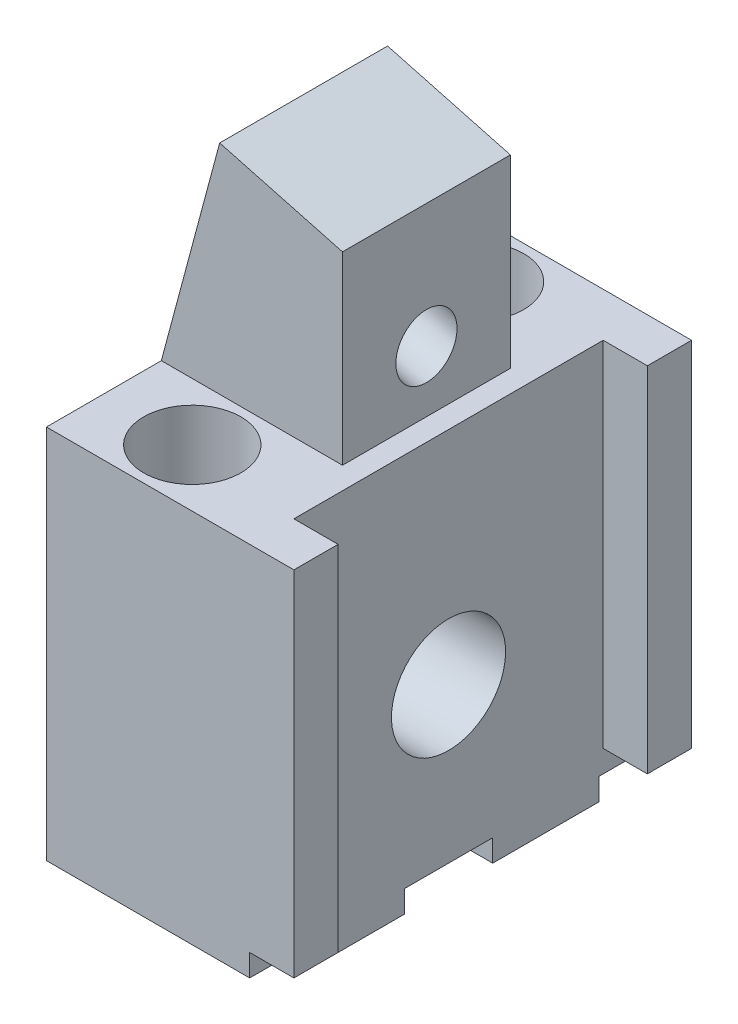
ISO-10303-21;
HEADER;
FILE_DESCRIPTION(('STEP AP214'),'2;1');
FILE_NAME('part.step','',(''),(''),'','','');
FILE_SCHEMA(('AUTOMOTIVE_DESIGN { 1 0 10303 214 1 1 1 1 }'));
ENDSEC;
DATA;
#1=APPLICATION_CONTEXT('core data for automotive mechanical design processes');
#2=APPLICATION_PROTOCOL_DEFINITION('international standard','automotive_design',2000,#1);
#3=PRODUCT_CONTEXT('',#1,'mechanical');
#4=PRODUCT('Part','Part','',(#3));
#5=PRODUCT_RELATED_PRODUCT_CATEGORY('part','',(#4));
#6=PRODUCT_DEFINITION_FORMATION('','',#4);
#7=PRODUCT_DEFINITION_CONTEXT('part definition',#1,'design');
#8=PRODUCT_DEFINITION('design','',#6,#7);
#9=PRODUCT_DEFINITION_SHAPE('','',#8);
#10=(LENGTH_UNIT() NAMED_UNIT(*) SI_UNIT(.MILLI.,.METRE.));
#11=(NAMED_UNIT(*) PLANE_ANGLE_UNIT() SI_UNIT($,.RADIAN.));
#12=(NAMED_UNIT(*) SI_UNIT($,.STERADIAN.) SOLID_ANGLE_UNIT());
#13=UNCERTAINTY_MEASURE_WITH_UNIT(LENGTH_MEASURE(1.E-05),#10,'distance_accuracy_value','');
#14=(GEOMETRIC_REPRESENTATION_CONTEXT(3) GLOBAL_UNCERTAINTY_ASSIGNED_CONTEXT((#13)) GLOBAL_UNIT_ASSIGNED_CONTEXT((#10,
#11,#12)) REPRESENTATION_CONTEXT('',''));
#15=CARTESIAN_POINT('',(0.,0.,0.));
#16=DIRECTION('',(0.,0.,1.));
#17=DIRECTION('',(1.,0.,0.));
#18=AXIS2_PLACEMENT_3D('',#15,#16,#17);
#19=CARTESIAN_POINT('',(8.51846013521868,0.662015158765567,67.5166604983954));
#20=DIRECTION('',(-1.,0.,0.));
#21=DIRECTION('',(0.,0.,1.));
#22=AXIS2_PLACEMENT_3D('',#19,#20,#21);
#23=CONICAL_SURFACE('',#22,2.45849999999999,1.02974425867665);
#24=CARTESIAN_POINT('',(8.51846013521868,0.66201515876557,67.5166604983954));
#25=DIRECTION('',(-1.,0.,0.));
#26=DIRECTION('',(0.,0.,1.));
#27=AXIS2_PLACEMENT_3D('',#24,#25,#26);
#28=CIRCLE('',#27,2.45849999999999);
#29=CARTESIAN_POINT('',(8.51846013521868,0.66201515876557,69.9751604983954));
#30=VERTEX_POINT('',#29);
#31=EDGE_CURVE('E397',#30,#30,#28,.T.);
#32=ORIENTED_EDGE('',*,*,#31,.T.);
#33=EDGE_LOOP('',(#32));
#34=FACE_BOUND('',#33,.T.);
#35=CARTESIAN_POINT('',(9.99567596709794,0.662015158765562,67.5166604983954));
#36=VERTEX_POINT('',#35);
#37=VERTEX_LOOP('',#36);
#38=FACE_BOUND('',#37,.T.);
#39=ADVANCED_FACE('F16',(#34,#38),#23,.F.);
#40=CARTESIAN_POINT('',(8.51846013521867,0.662015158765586,22.4833395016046));
#41=DIRECTION('',(-1.,0.,0.));
#42=DIRECTION('',(0.,0.,1.));
#43=AXIS2_PLACEMENT_3D('',#40,#41,#42);
#44=CONICAL_SURFACE('',#43,2.4585,1.02974425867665);
#45=CARTESIAN_POINT('',(8.51846013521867,0.662015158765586,22.4833395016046));
#46=DIRECTION('',(-1.,0.,0.));
#47=DIRECTION('',(0.,0.,1.));
#48=AXIS2_PLACEMENT_3D('',#45,#46,#47);
#49=CIRCLE('',#48,2.4585);
#50=CARTESIAN_POINT('',(8.51846013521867,0.662015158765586,24.9418395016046));
#51=VERTEX_POINT('',#50);
#52=EDGE_CURVE('E394',#51,#51,#49,.T.);
#53=ORIENTED_EDGE('',*,*,#52,.T.);
#54=EDGE_LOOP('',(#53));
#55=FACE_BOUND('',#54,.T.);
#56=CARTESIAN_POINT('',(9.99567596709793,0.662015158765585,22.4833395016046));
#57=VERTEX_POINT('',#56);
#58=VERTEX_LOOP('',#57);
#59=FACE_BOUND('',#58,.T.);
#60=ADVANCED_FACE('F544',(#55,#59),#44,.F.);
#61=CARTESIAN_POINT('',(8.51846013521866,39.6620151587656,45.));
#62=DIRECTION('',(-1.,0.,0.));
#63=DIRECTION('',(0.,0.,1.));
#64=AXIS2_PLACEMENT_3D('',#61,#62,#63);
#65=CONICAL_SURFACE('',#64,2.4585,1.02974425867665);
#66=CARTESIAN_POINT('',(8.51846013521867,39.6620151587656,45.));
#67=DIRECTION('',(-1.,0.,0.));
#68=DIRECTION('',(0.,0.,1.));
#69=AXIS2_PLACEMENT_3D('',#66,#67,#68);
#70=CIRCLE('',#69,2.4585);
#71=CARTESIAN_POINT('',(8.51846013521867,39.6620151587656,47.4585));
#72=VERTEX_POINT('',#71);
#73=EDGE_CURVE('E391',#72,#72,#70,.T.);
#74=ORIENTED_EDGE('',*,*,#73,.T.);
#75=EDGE_LOOP('',(#74));
#76=FACE_BOUND('',#75,.T.);
#77=CARTESIAN_POINT('',(9.99567596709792,39.6620151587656,45.));
#78=VERTEX_POINT('',#77);
#79=VERTEX_LOOP('',#78);
#80=FACE_BOUND('',#79,.T.);
#81=ADVANCED_FACE('F548',(#76,#80),#65,.F.);
#82=CARTESIAN_POINT('',(-11.9403307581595,87.2918301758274,45.));
#83=DIRECTION('',(0.965925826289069,-0.25881904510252,0.));
#84=DIRECTION('',(0.25881904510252,0.965925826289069,0.));
#85=AXIS2_PLACEMENT_3D('',#82,#83,#84);
#86=CYLINDRICAL_SURFACE('',#85,6.9175);
#87=CARTESIAN_POINT('',(-10.2698827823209,86.8442349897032,45.));
#88=DIRECTION('',(0.965925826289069,-0.25881904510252,0.));
#89=DIRECTION('',(0.25881904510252,0.965925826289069,0.));
#90=AXIS2_PLACEMENT_3D('',#87,#88,#89);
#91=CIRCLE('',#90,6.9175);
#92=CARTESIAN_POINT('',(-8.47950203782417,93.5260268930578,45.));
#93=VERTEX_POINT('',#92);
#94=EDGE_CURVE('E20',#93,#93,#91,.T.);
#95=ORIENTED_EDGE('',*,*,#94,.F.);
#96=EDGE_LOOP('',(#95));
#97=FACE_BOUND('',#96,.T.);
#98=CARTESIAN_POINT('',(24.5184601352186,77.5227265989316,45.));
#99=DIRECTION('',(1.,0.,0.));
#100=DIRECTION('',(0.,-1.,0.));
#101=AXIS2_PLACEMENT_3D('',#98,#99,#100);
#102=ELLIPSE('',#101,7.16152297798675,6.9175);
#103=CARTESIAN_POINT('',(24.5184601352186,70.3612036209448,45.));
#104=VERTEX_POINT('',#103);
#105=EDGE_CURVE('E413',#104,#104,#102,.F.);
#106=ORIENTED_EDGE('',*,*,#105,.F.);
#107=EDGE_LOOP('',(#106));
#108=FACE_BOUND('',#107,.T.);
#109=ADVANCED_FACE('F552',(#97,#108),#86,.F.);
#110=CARTESIAN_POINT('',(-3.27732489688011,112.940816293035,0.));
#111=DIRECTION('',(0.25881904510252,0.965925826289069,0.));
#112=DIRECTION('',(-0.965925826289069,0.25881904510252,0.));
#113=AXIS2_PLACEMENT_3D('',#110,#111,#112);
#114=PLANE('',#113);
#115=DIRECTION('',(0.,0.,1.));
#116=VECTOR('',#115,1.);
#117=CARTESIAN_POINT('',(-3.27732489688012,112.940816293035,0.));
#118=LINE('',#117,#116);
#119=CARTESIAN_POINT('',(-3.27732489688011,112.940816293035,64.));
#120=VERTEX_POINT('',#119);
#121=CARTESIAN_POINT('',(-3.27732489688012,112.940816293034,26.));
#122=VERTEX_POINT('',#121);
#123=EDGE_CURVE('E172',#120,#122,#118,.F.);
#124=ORIENTED_EDGE('',*,*,#123,.F.);
#125=DIRECTION('',(-0.965925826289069,0.258819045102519,0.));
#126=VECTOR('',#125,1.);
#127=CARTESIAN_POINT('',(24.5184601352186,105.492958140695,64.));
#128=LINE('',#127,#126);
#129=CARTESIAN_POINT('',(24.5184601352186,105.492958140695,64.));
#130=VERTEX_POINT('',#129);
#131=EDGE_CURVE('E706',#130,#120,#128,.T.);
#132=ORIENTED_EDGE('',*,*,#131,.F.);
#133=DIRECTION('',(0.,0.,-1.));
#134=VECTOR('',#133,1.);
#135=CARTESIAN_POINT('',(24.5184601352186,105.492958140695,45.));
#136=LINE('',#135,#134);
#137=CARTESIAN_POINT('',(24.5184601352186,105.492958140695,26.));
#138=VERTEX_POINT('',#137);
#139=EDGE_CURVE('E408',#138,#130,#136,.F.);
#140=ORIENTED_EDGE('',*,*,#139,.F.);
#141=DIRECTION('',(0.965925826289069,-0.258819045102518,0.));
#142=VECTOR('',#141,1.);
#143=CARTESIAN_POINT('',(-3.27732489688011,112.940816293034,26.));
#144=LINE('',#143,#142);
#145=EDGE_CURVE('E411',#122,#138,#144,.T.);
#146=ORIENTED_EDGE('',*,*,#145,.F.);
#147=EDGE_LOOP('',(#124,#132,#140,#146));
#148=FACE_BOUND('',#147,.T.);
#149=ADVANCED_FACE('F556',(#148),#114,.T.);
#150=CARTESIAN_POINT('',(-7.48153986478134,47.6620151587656,65.78));
#151=DIRECTION('',(0.,-1.,0.));
#152=DIRECTION('',(1.,0.,0.));
#153=AXIS2_PLACEMENT_3D('',#150,#151,#152);
#154=PLANE('',#153);
#155=CARTESIAN_POINT('',(3.51846013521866,47.6620151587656,77.));
#156=DIRECTION('',(0.,-1.,0.));
#157=DIRECTION('',(0.,0.,-1.));
#158=AXIS2_PLACEMENT_3D('',#155,#156,#157);
#159=CIRCLE('',#158,7.5);
#160=CARTESIAN_POINT('',(3.51846013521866,47.6620151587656,69.5));
#161=VERTEX_POINT('',#160);
#162=EDGE_CURVE('E358',#161,#161,#159,.T.);
#163=ORIENTED_EDGE('',*,*,#162,.T.);
#164=EDGE_LOOP('',(#163));
#165=FACE_BOUND('',#164,.T.);
#166=CARTESIAN_POINT('',(3.51846013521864,47.6620151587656,77.));
#167=DIRECTION('',(0.,-1.,0.));
#168=DIRECTION('',(0.,0.,-1.));
#169=AXIS2_PLACEMENT_3D('',#166,#167,#168);
#170=CIRCLE('',#169,11.);
#171=CARTESIAN_POINT('',(3.51846013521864,47.6620151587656,66.));
#172=VERTEX_POINT('',#171);
#173=EDGE_CURVE('E710',#172,#172,#170,.F.);
#174=ORIENTED_EDGE('',*,*,#173,.T.);
#175=EDGE_LOOP('',(#174));
#176=FACE_BOUND('',#175,.T.);
#177=ADVANCED_FACE('F558',(#165,#176),#154,.F.);
#178=CARTESIAN_POINT('',(3.51846013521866,47.6620151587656,13.));
#179=DIRECTION('',(0.,-1.,0.));
#180=DIRECTION('',(0.,0.,-1.));
#181=AXIS2_PLACEMENT_3D('',#178,#179,#180);
#182=PLANE('',#181);
#183=CARTESIAN_POINT('',(3.51846013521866,47.6620151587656,13.));
#184=DIRECTION('',(0.,-1.,0.));
#185=DIRECTION('',(0.,0.,-1.));
#186=AXIS2_PLACEMENT_3D('',#183,#184,#185);
#187=CIRCLE('',#186,7.5);
#188=CARTESIAN_POINT('',(3.51846013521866,47.6620151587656,5.5));
#189=VERTEX_POINT('',#188);
#190=EDGE_CURVE('E278',#189,#189,#187,.T.);
#191=ORIENTED_EDGE('',*,*,#190,.T.);
#192=EDGE_LOOP('',(#191));
#193=FACE_BOUND('',#192,.T.);
#194=CARTESIAN_POINT('',(3.51846013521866,47.6620151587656,13.));
#195=DIRECTION('',(0.,-1.,0.));
#196=DIRECTION('',(0.,0.,-1.));
#197=AXIS2_PLACEMENT_3D('',#194,#195,#196);
#198=CIRCLE('',#197,11.);
#199=CARTESIAN_POINT('',(3.51846013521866,47.6620151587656,2.));
#200=VERTEX_POINT('',#199);
#201=EDGE_CURVE('E572',#200,#200,#198,.F.);
#202=ORIENTED_EDGE('',*,*,#201,.T.);
#203=EDGE_LOOP('',(#202));
#204=FACE_BOUND('',#203,.T.);
#205=ADVANCED_FACE('F560',(#193,#204),#182,.F.);
#206=CARTESIAN_POINT('',(-16.4815398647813,63.6620151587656,0.));
#207=DIRECTION('',(-0.965925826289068,0.25881904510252,0.));
#208=DIRECTION('',(-0.25881904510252,-0.965925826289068,0.));
#209=AXIS2_PLACEMENT_3D('',#206,#207,#208);
#210=PLANE('',#209);
#211=ORIENTED_EDGE('',*,*,#94,.T.);
#212=EDGE_LOOP('',(#211));
#213=FACE_BOUND('',#212,.T.);
#214=DIRECTION('',(-0.25881904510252,-0.965925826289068,0.));
#215=VECTOR('',#214,1.);
#216=CARTESIAN_POINT('',(-3.27732489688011,112.940816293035,64.));
#217=LINE('',#216,#215);
#218=CARTESIAN_POINT('',(-16.4815398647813,63.6620151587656,64.));
#219=VERTEX_POINT('',#218);
#220=EDGE_CURVE('E709',#120,#219,#217,.T.);
#221=ORIENTED_EDGE('',*,*,#220,.F.);
#222=ORIENTED_EDGE('',*,*,#123,.T.);
#223=DIRECTION('',(0.25881904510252,0.965925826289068,0.));
#224=VECTOR('',#223,1.);
#225=CARTESIAN_POINT('',(-16.4815398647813,63.6620151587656,26.));
#226=LINE('',#225,#224);
#227=CARTESIAN_POINT('',(-16.4815398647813,63.6620151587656,26.));
#228=VERTEX_POINT('',#227);
#229=EDGE_CURVE('E162',#228,#122,#226,.T.);
#230=ORIENTED_EDGE('',*,*,#229,.F.);
#231=DIRECTION('',(0.,0.,1.));
#232=VECTOR('',#231,1.);
#233=CARTESIAN_POINT('',(-16.4815398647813,63.6620151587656,0.));
#234=LINE('',#233,#232);
#235=EDGE_CURVE('E289',#219,#228,#234,.F.);
#236=ORIENTED_EDGE('',*,*,#235,.F.);
#237=EDGE_LOOP('',(#221,#222,#230,#236));
#238=FACE_BOUND('',#237,.T.);
#239=ADVANCED_FACE('F610',(#213,#238),#210,.T.);
#240=CARTESIAN_POINT('',(-16.4815398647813,13.6620151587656,45.));
#241=DIRECTION('',(1.,0.,0.));
#242=DIRECTION('',(0.,0.,-1.));
#243=AXIS2_PLACEMENT_3D('',#240,#241,#242);
#244=CYLINDRICAL_SURFACE('',#243,34.);
#245=CARTESIAN_POINT('',(-11.4815398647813,13.6620151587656,45.));
#246=DIRECTION('',(1.,0.,0.));
#247=DIRECTION('',(0.,0.,-1.));
#248=AXIS2_PLACEMENT_3D('',#245,#246,#247);
#249=CIRCLE('',#248,34.);
#250=CARTESIAN_POINT('',(-11.4815398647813,13.6620151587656,11.));
#251=VERTEX_POINT('',#250);
#252=EDGE_CURVE('E442',#251,#251,#249,.T.);
#253=ORIENTED_EDGE('',*,*,#252,.T.);
#254=EDGE_LOOP('',(#253));
#255=FACE_BOUND('',#254,.T.);
#256=CARTESIAN_POINT('',(-16.4815398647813,13.6620151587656,45.));
#257=DIRECTION('',(1.,0.,0.));
#258=DIRECTION('',(0.,0.,-1.));
#259=AXIS2_PLACEMENT_3D('',#256,#257,#258);
#260=CIRCLE('',#259,34.);
#261=CARTESIAN_POINT('',(-16.4815398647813,13.6620151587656,11.));
#262=VERTEX_POINT('',#261);
#263=EDGE_CURVE('E288',#262,#262,#260,.T.);
#264=ORIENTED_EDGE('',*,*,#263,.F.);
#265=EDGE_LOOP('',(#264));
#266=FACE_BOUND('',#265,.T.);
#267=ADVANCED_FACE('F565',(#255,#266),#244,.F.);
#268=CARTESIAN_POINT('',(-11.4815398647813,0.662015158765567,67.5166604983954));
#269=DIRECTION('',(1.,0.,0.));
#270=DIRECTION('',(0.,1.,0.));
#271=AXIS2_PLACEMENT_3D('',#268,#269,#270);
#272=CYLINDRICAL_SURFACE('',#271,2.45849999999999);
#273=ORIENTED_EDGE('',*,*,#31,.F.);
#274=EDGE_LOOP('',(#273));
#275=FACE_BOUND('',#274,.T.);
#276=CARTESIAN_POINT('',(-11.4815398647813,0.662015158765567,67.5166604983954));
#277=DIRECTION('',(1.,0.,0.));
#278=DIRECTION('',(0.,1.,0.));
#279=AXIS2_PLACEMENT_3D('',#276,#277,#278);
#280=CIRCLE('',#279,2.45849999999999);
#281=CARTESIAN_POINT('',(-11.4815398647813,3.12051515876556,67.5166604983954));
#282=VERTEX_POINT('',#281);
#283=EDGE_CURVE('E439',#282,#282,#280,.F.);
#284=ORIENTED_EDGE('',*,*,#283,.T.);
#285=EDGE_LOOP('',(#284));
#286=FACE_BOUND('',#285,.T.);
#287=CARTESIAN_POINT('',(0.8913647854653,0.662015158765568,69.9751604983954));
#288=CARTESIAN_POINT('',(0.891368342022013,0.610180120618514,69.9751587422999));
#289=CARTESIAN_POINT('',(0.895783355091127,0.55832340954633,69.9735032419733));
#290=CARTESIAN_POINT('',(0.91308727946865,0.456239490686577,69.9670694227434));
#291=CARTESIAN_POINT('',(0.925983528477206,0.40601373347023,69.9622883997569));
#292=CARTESIAN_POINT('',(0.959187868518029,0.308808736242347,69.9501467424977));
#293=CARTESIAN_POINT('',(0.979448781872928,0.261811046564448,69.9428025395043));
#294=CARTESIAN_POINT('',(1.02619923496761,0.171440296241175,69.9261571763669));
#295=CARTESIAN_POINT('',(1.05269100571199,0.128068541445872,69.9168553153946));
#296=CARTESIAN_POINT('',(1.1269728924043,0.0220614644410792,69.8913393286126));
#297=CARTESIAN_POINT('',(1.17839267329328,-0.0377965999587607,69.8741670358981));
#298=CARTESIAN_POINT('',(1.28992609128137,-0.148341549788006,69.8385001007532));
#299=CARTESIAN_POINT('',(1.35006297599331,-0.199003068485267,69.8200019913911));
#300=CARTESIAN_POINT('',(1.46336234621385,-0.282423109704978,69.7868652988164));
#301=CARTESIAN_POINT('',(1.51541176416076,-0.316720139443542,69.7722161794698));
#302=CARTESIAN_POINT('',(1.62245906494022,-0.380618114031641,69.7433986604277));
#303=CARTESIAN_POINT('',(1.67745868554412,-0.410216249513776,69.7292305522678));
#304=CARTESIAN_POINT('',(1.84597490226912,-0.492787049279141,69.6879475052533));
#305=CARTESIAN_POINT('',(1.96290706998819,-0.539465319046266,69.6620842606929));
#306=CARTESIAN_POINT('',(2.17969478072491,-0.611747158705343,69.6197838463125));
#307=CARTESIAN_POINT('',(2.27865716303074,-0.639659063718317,69.6024883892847));
#308=CARTESIAN_POINT('',(2.47907883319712,-0.687778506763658,69.5716787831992));
#309=CARTESIAN_POINT('',(2.58053960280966,-0.707981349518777,69.5581669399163));
#310=CARTESIAN_POINT('',(2.78515356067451,-0.741564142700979,69.5352237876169));
#311=CARTESIAN_POINT('',(2.88830879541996,-0.754935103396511,69.5257978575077));
#312=CARTESIAN_POINT('',(3.09554314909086,-0.775392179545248,69.5112128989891));
#313=CARTESIAN_POINT('',(3.19962236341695,-0.782477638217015,69.5060543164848));
#314=CARTESIAN_POINT('',(3.41297426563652,-0.790851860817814,69.49994779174));
#315=CARTESIAN_POINT('',(3.52226400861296,-0.791856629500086,69.4992061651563));
#316=CARTESIAN_POINT('',(3.74065998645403,-0.787358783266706,69.5024965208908));
#317=CARTESIAN_POINT('',(3.84976617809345,-0.781854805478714,69.5065295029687));
#318=CARTESIAN_POINT('',(4.066987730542,-0.764096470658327,69.5192963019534));
#319=CARTESIAN_POINT('',(4.17510440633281,-0.751853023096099,69.5280225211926));
#320=CARTESIAN_POINT('',(4.38973623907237,-0.720058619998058,69.5499984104));
#321=CARTESIAN_POINT('',(4.49625211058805,-0.700511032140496,69.5632459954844));
#322=CARTESIAN_POINT('',(4.73196888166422,-0.647540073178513,69.5976564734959));
#323=CARTESIAN_POINT('',(4.86054231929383,-0.611922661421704,69.6199524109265));
#324=CARTESIAN_POINT('',(5.0485671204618,-0.547035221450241,69.657460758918));
#325=CARTESIAN_POINT('',(5.1104308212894,-0.523498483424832,69.6706395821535));
#326=CARTESIAN_POINT('',(5.23208237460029,-0.472130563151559,69.6981248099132));
#327=CARTESIAN_POINT('',(5.29187084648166,-0.44430067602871,69.7124308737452));
#328=CARTESIAN_POINT('',(5.43365879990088,-0.370945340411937,69.7481466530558));
#329=CARTESIAN_POINT('',(5.51429141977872,-0.322927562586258,69.769990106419));
#330=CARTESIAN_POINT('',(5.66739477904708,-0.215343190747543,69.8140147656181));
#331=CARTESIAN_POINT('',(5.73988048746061,-0.155798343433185,69.8361952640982));
#332=CARTESIAN_POINT('',(5.85113848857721,-0.0448277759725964,69.8718258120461));
#333=CARTESIAN_POINT('',(5.89325796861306,0.0030549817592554,69.8857903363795));
#334=CARTESIAN_POINT('',(5.96986171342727,0.105075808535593,69.9118225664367));
#335=CARTESIAN_POINT('',(6.0043566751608,0.159204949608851,69.9238929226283));
#336=CARTESIAN_POINT('',(6.05788386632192,0.262554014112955,69.9429479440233));
#337=CARTESIAN_POINT('',(6.07860187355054,0.310796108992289,69.9504616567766));
#338=CARTESIAN_POINT('',(6.11219299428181,0.410286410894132,69.9627510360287));
#339=CARTESIAN_POINT('',(6.1250717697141,0.461532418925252,69.9675286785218));
#340=CARTESIAN_POINT('',(6.14204465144,0.565961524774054,69.9738423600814));
#341=CARTESIAN_POINT('',(6.14609212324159,0.619153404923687,69.9753611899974));
#342=CARTESIAN_POINT('',(6.14490412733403,0.725416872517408,69.9749169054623));
#343=CARTESIAN_POINT('',(6.1396692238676,0.778488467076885,69.9729540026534));
#344=CARTESIAN_POINT('',(6.12117876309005,0.878441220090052,69.966086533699));
#345=CARTESIAN_POINT('',(6.10861832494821,0.925472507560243,69.9614372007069));
#346=CARTESIAN_POINT('',(6.07689674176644,1.01693012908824,69.9498449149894));
#347=CARTESIAN_POINT('',(6.05773328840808,1.06135554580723,69.9429011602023));
#348=CARTESIAN_POINT('',(6.00483962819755,1.16443129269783,69.9240560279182));
#349=CARTESIAN_POINT('',(5.96835534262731,1.22150825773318,69.9112872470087));
#350=CARTESIAN_POINT('',(5.88697489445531,1.32873736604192,69.8836810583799));
#351=CARTESIAN_POINT('',(5.84206016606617,1.3788737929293,69.8688391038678));
#352=CARTESIAN_POINT('',(5.72177297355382,1.49609060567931,69.8305429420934));
#353=CARTESIAN_POINT('',(5.64247735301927,1.55893346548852,69.8065261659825));
#354=CARTESIAN_POINT('',(5.47497484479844,1.67153485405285,69.7591654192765));
#355=CARTESIAN_POINT('',(5.38674927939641,1.72126514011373,69.7358229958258));
#356=CARTESIAN_POINT('',(5.22018946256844,1.80213423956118,69.6951955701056));
#357=CARTESIAN_POINT('',(5.14275986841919,1.83499926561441,69.6775588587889));
#358=CARTESIAN_POINT('',(4.98499691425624,1.89423609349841,69.64433739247));
#359=CARTESIAN_POINT('',(4.90466174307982,1.92060376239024,69.6287539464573));
#360=CARTESIAN_POINT('',(4.74179648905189,1.96768127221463,69.5999796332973));
#361=CARTESIAN_POINT('',(4.65926284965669,1.9883812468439,69.5867929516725));
#362=CARTESIAN_POINT('',(4.49270236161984,2.02469636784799,69.5630695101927));
#363=CARTESIAN_POINT('',(4.40867512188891,2.04031016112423,69.5525334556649));
#364=CARTESIAN_POINT('',(4.20468733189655,2.07241384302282,69.5304945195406));
#365=CARTESIAN_POINT('',(4.08420923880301,2.08660575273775,69.5203872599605));
#366=CARTESIAN_POINT('',(3.84218194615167,2.10661393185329,69.5060079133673));
#367=CARTESIAN_POINT('',(3.7206322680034,2.11242624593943,69.5017385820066));
#368=CARTESIAN_POINT('',(3.47733818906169,2.11599501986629,69.4991260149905));
#369=CARTESIAN_POINT('',(3.3555937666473,2.11375051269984,69.5007834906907));
#370=CARTESIAN_POINT('',(3.11279047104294,2.10107940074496,69.5099948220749));
#371=CARTESIAN_POINT('',(2.99173132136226,2.09065637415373,69.5175460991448));
#372=CARTESIAN_POINT('',(2.78446235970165,2.06512162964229,69.535491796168));
#373=CARTESIAN_POINT('',(2.6978715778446,2.05210307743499,69.544522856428));
#374=CARTESIAN_POINT('',(2.52594963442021,2.02106053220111,69.565457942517));
#375=CARTESIAN_POINT('',(2.44061819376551,2.00303766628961,69.5773613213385));
#376=CARTESIAN_POINT('',(2.27191893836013,1.96146674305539,69.6038248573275));
#377=CARTESIAN_POINT('',(2.18854722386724,1.93793090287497,69.6183791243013));
#378=CARTESIAN_POINT('',(2.02433200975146,1.88457122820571,69.6498595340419));
#379=CARTESIAN_POINT('',(1.94348710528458,1.85475096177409,69.6667843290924));
#380=CARTESIAN_POINT('',(1.77385398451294,1.78302565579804,69.7051424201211));
#381=CARTESIAN_POINT('',(1.68559807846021,1.73999881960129,69.7268739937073));
#382=CARTESIAN_POINT('',(1.5158684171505,1.64261591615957,69.7717710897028));
#383=CARTESIAN_POINT('',(1.43438858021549,1.58827016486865,69.7949352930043));
#384=CARTESIAN_POINT('',(1.30122674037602,1.48173775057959,69.8349857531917));
#385=CARTESIAN_POINT('',(1.24723170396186,1.43250635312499,69.8519726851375));
#386=CARTESIAN_POINT('',(1.14737018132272,1.32591362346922,69.8844765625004));
#387=CARTESIAN_POINT('',(1.1014906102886,1.26856565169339,69.8999958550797));
#388=CARTESIAN_POINT('',(1.03117289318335,1.16133887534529,69.9243780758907));
#389=CARTESIAN_POINT('',(1.00424809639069,1.11325697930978,69.9339308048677));
#390=CARTESIAN_POINT('',(0.958184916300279,1.01309544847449,69.9504898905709));
#391=CARTESIAN_POINT('',(0.939033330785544,0.961022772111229,69.9575005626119));
#392=CARTESIAN_POINT('',(0.913618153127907,0.867703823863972,69.9668689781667));
#393=CARTESIAN_POINT('',(0.905313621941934,0.827082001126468,69.9699572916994));
#394=CARTESIAN_POINT('',(0.894185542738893,0.744983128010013,69.974103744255));
#395=CARTESIAN_POINT('',(0.891361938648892,0.703506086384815,69.9751619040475));
#396=CARTESIAN_POINT('',(0.8913647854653,0.662015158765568,69.9751604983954));
#397=B_SPLINE_CURVE_WITH_KNOTS('',3,(#287,#288,#289,#290,#291,#292,#293,#294,#295,#296,#297,
#298,#299,#300,#301,#302,#303,#304,#305,#306,#307,#308,#309,#310,#311,#312,#313,#314,#315,#316,
#317,#318,#319,#320,#321,#322,#323,#324,#325,#326,#327,#328,#329,#330,#331,#332,#333,#334,#335,
#336,#337,#338,#339,#340,#341,#342,#343,#344,#345,#346,#347,#348,#349,#350,#351,#352,#353,#354,
#355,#356,#357,#358,#359,#360,#361,#362,#363,#364,#365,#366,#367,#368,#369,#370,#371,#372,#373,
#374,#375,#376,#377,#378,#379,#380,#381,#382,#383,#384,#385,#386,#387,#388,#389,#390,#391,#392,
#393,#394,#395,#396),.UNSPECIFIED.,.T.,.F.,(4,2,2,2,2,2,2,2,2,2,2,2,2,2,2,2,2,2,2,2,2,2,2,2,2,2,
2,2,2,2,2,2,2,2,2,2,2,2,2,2,2,2,2,2,2,2,2,2,2,2,2,2,2,2,4),(0.,0.155338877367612,
0.310812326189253,0.465306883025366,0.619856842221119,0.860761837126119,1.10232154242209,
1.29414947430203,1.48609166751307,1.8703547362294,2.18279683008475,2.49542891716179,
2.80847132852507,3.12154644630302,3.44913728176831,3.77679672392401,4.10392732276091,
4.43090727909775,4.83562684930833,5.03795028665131,5.24021280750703,5.5284881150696,
5.81622477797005,6.01146772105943,6.20643498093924,6.36490511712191,6.52326066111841,
6.68245041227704,6.84163048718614,6.98771789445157,7.13385642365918,7.33949916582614,
7.54560021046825,7.85583231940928,8.1667272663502,8.42421067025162,8.68185743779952,
8.93994990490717,9.19811097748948,9.56281903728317,9.92769918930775,10.2926231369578,
10.6573875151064,10.9212987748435,11.1851506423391,11.4484232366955,11.7115467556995,
12.0125557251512,12.3132915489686,12.5376699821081,12.7616832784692,12.9288570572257,
13.095745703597,13.2200866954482,13.3444264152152),.UNSPECIFIED.);
#398=CARTESIAN_POINT('',(0.8913647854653,0.662015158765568,69.9751604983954));
#399=VERTEX_POINT('',#398);
#400=EDGE_CURVE('E567',#399,#399,#397,.T.);
#401=ORIENTED_EDGE('',*,*,#400,.T.);
#402=EDGE_LOOP('',(#401));
#403=FACE_BOUND('',#402,.T.);
#404=ADVANCED_FACE('F562',(#275,#286,#403),#272,.F.);
#405=CARTESIAN_POINT('',(-11.4815398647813,0.662015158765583,22.4833395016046));
#406=DIRECTION('',(1.,0.,0.));
#407=DIRECTION('',(0.,0.,-1.));
#408=AXIS2_PLACEMENT_3D('',#405,#406,#407);
#409=CYLINDRICAL_SURFACE('',#408,2.4585);
#410=ORIENTED_EDGE('',*,*,#52,.F.);
#411=EDGE_LOOP('',(#410));
#412=FACE_BOUND('',#411,.T.);
#413=CARTESIAN_POINT('',(-11.4815398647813,0.662015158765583,22.4833395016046));
#414=DIRECTION('',(1.,0.,0.));
#415=DIRECTION('',(0.,0.,-1.));
#416=AXIS2_PLACEMENT_3D('',#413,#414,#415);
#417=CIRCLE('',#416,2.4585);
#418=CARTESIAN_POINT('',(-11.4815398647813,0.662015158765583,20.0248395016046));
#419=VERTEX_POINT('',#418);
#420=EDGE_CURVE('E436',#419,#419,#417,.F.);
#421=ORIENTED_EDGE('',*,*,#420,.T.);
#422=EDGE_LOOP('',(#421));
#423=FACE_BOUND('',#422,.T.);
#424=CARTESIAN_POINT('',(0.891364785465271,0.662015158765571,20.0248395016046));
#425=CARTESIAN_POINT('',(0.891368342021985,0.713850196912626,20.0248412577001));
#426=CARTESIAN_POINT('',(0.895783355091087,0.765706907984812,20.0264967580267));
#427=CARTESIAN_POINT('',(0.913087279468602,0.867790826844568,20.0329305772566));
#428=CARTESIAN_POINT('',(0.925983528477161,0.918016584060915,20.037711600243));
#429=CARTESIAN_POINT('',(0.959187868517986,1.0152215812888,20.0498532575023));
#430=CARTESIAN_POINT('',(0.979448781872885,1.0622192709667,20.0571974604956));
#431=CARTESIAN_POINT('',(1.02619923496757,1.15259002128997,20.0738428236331));
#432=CARTESIAN_POINT('',(1.05269100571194,1.19596177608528,20.0831446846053));
#433=CARTESIAN_POINT('',(1.12697289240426,1.30196885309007,20.1086606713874));
#434=CARTESIAN_POINT('',(1.17839267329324,1.36182691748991,20.1258329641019));
#435=CARTESIAN_POINT('',(1.28992609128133,1.47237186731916,20.1614998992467));
#436=CARTESIAN_POINT('',(1.35006297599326,1.52303338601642,20.1799980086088));
#437=CARTESIAN_POINT('',(1.46336234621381,1.60645342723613,20.2131347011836));
#438=CARTESIAN_POINT('',(1.51541176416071,1.64075045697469,20.2277838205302));
#439=CARTESIAN_POINT('',(1.62245906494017,1.70464843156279,20.2566013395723));
#440=CARTESIAN_POINT('',(1.67745868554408,1.73424656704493,20.2707694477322));
#441=CARTESIAN_POINT('',(1.84597490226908,1.8168173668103,20.3120524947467));
#442=CARTESIAN_POINT('',(1.96290706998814,1.86349563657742,20.3379157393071));
#443=CARTESIAN_POINT('',(2.17969478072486,1.9357774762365,20.3802161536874));
#444=CARTESIAN_POINT('',(2.27865716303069,1.96368938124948,20.3975116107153));
#445=CARTESIAN_POINT('',(2.47907883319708,2.01180882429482,20.4283212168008));
#446=CARTESIAN_POINT('',(2.58053960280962,2.03201166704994,20.4418330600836));
#447=CARTESIAN_POINT('',(2.78515356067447,2.06559446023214,20.4647762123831));
#448=CARTESIAN_POINT('',(2.88830879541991,2.07896542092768,20.4742021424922));
#449=CARTESIAN_POINT('',(3.09554314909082,2.09942249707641,20.4887871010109));
#450=CARTESIAN_POINT('',(3.19962236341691,2.10650795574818,20.4939456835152));
#451=CARTESIAN_POINT('',(3.41297426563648,2.11488217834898,20.50005220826));
#452=CARTESIAN_POINT('',(3.52226400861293,2.11588694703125,20.5007938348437));
#453=CARTESIAN_POINT('',(3.74065998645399,2.11138910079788,20.4975034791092));
#454=CARTESIAN_POINT('',(3.84976617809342,2.10588512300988,20.4934704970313));
#455=CARTESIAN_POINT('',(4.06698773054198,2.0881267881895,20.4807036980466));
#456=CARTESIAN_POINT('',(4.17510440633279,2.07588334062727,20.4719774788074));
#457=CARTESIAN_POINT('',(4.38973623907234,2.04408893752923,20.4500015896));
#458=CARTESIAN_POINT('',(4.49625211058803,2.02454134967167,20.4367540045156));
#459=CARTESIAN_POINT('',(4.7319688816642,1.97157039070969,20.4023435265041));
#460=CARTESIAN_POINT('',(4.86054231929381,1.93595297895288,20.3800475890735));
#461=CARTESIAN_POINT('',(5.0485671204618,1.87106553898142,20.342539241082));
#462=CARTESIAN_POINT('',(5.1104308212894,1.84752880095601,20.3293604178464));
#463=CARTESIAN_POINT('',(5.23208237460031,1.79616088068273,20.3018751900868));
#464=CARTESIAN_POINT('',(5.29187084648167,1.76833099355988,20.2875691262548));
#465=CARTESIAN_POINT('',(5.4336587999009,1.69497565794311,20.2518533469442));
#466=CARTESIAN_POINT('',(5.51429141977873,1.64695788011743,20.230009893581));
#467=CARTESIAN_POINT('',(5.6673947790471,1.53937350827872,20.1859852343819));
#468=CARTESIAN_POINT('',(5.73988048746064,1.47982866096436,20.1638047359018));
#469=CARTESIAN_POINT('',(5.85113848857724,1.36885809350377,20.1281741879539));
#470=CARTESIAN_POINT('',(5.89325796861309,1.32097533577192,20.1142096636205));
#471=CARTESIAN_POINT('',(5.96986171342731,1.21895450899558,20.0881774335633));
#472=CARTESIAN_POINT('',(6.00435667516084,1.16482536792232,20.0761070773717));
#473=CARTESIAN_POINT('',(6.05788386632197,1.06147630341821,20.0570520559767));
#474=CARTESIAN_POINT('',(6.07860187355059,1.01323420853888,20.0495383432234));
#475=CARTESIAN_POINT('',(6.11219299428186,0.91374390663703,20.0372489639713));
#476=CARTESIAN_POINT('',(6.12507176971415,0.862497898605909,20.0324713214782));
#477=CARTESIAN_POINT('',(6.14204465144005,0.758068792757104,20.0261576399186));
#478=CARTESIAN_POINT('',(6.14609212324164,0.70487691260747,20.0246388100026));
#479=CARTESIAN_POINT('',(6.14490412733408,0.598613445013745,20.0250830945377));
#480=CARTESIAN_POINT('',(6.13966922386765,0.545541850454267,20.0270459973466));
#481=CARTESIAN_POINT('',(6.12117876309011,0.445589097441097,20.033913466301));
#482=CARTESIAN_POINT('',(6.10861832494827,0.398557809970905,20.0385627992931));
#483=CARTESIAN_POINT('',(6.0768967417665,0.3071001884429,20.0501550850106));
#484=CARTESIAN_POINT('',(6.05773328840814,0.262674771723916,20.0570988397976));
#485=CARTESIAN_POINT('',(6.00483962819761,0.159599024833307,20.0759439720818));
#486=CARTESIAN_POINT('',(5.96835534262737,0.102522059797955,20.0887127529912));
#487=CARTESIAN_POINT('',(5.88697489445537,-0.00470704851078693,20.1163189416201));
#488=CARTESIAN_POINT('',(5.84206016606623,-0.0548434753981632,20.1311608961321));
#489=CARTESIAN_POINT('',(5.72177297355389,-0.172060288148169,20.1694570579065));
#490=CARTESIAN_POINT('',(5.64247735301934,-0.234903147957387,20.1934738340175));
#491=CARTESIAN_POINT('',(5.47497484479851,-0.347504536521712,20.2408345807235));
#492=CARTESIAN_POINT('',(5.38674927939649,-0.397234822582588,20.2641770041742));
#493=CARTESIAN_POINT('',(5.22018946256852,-0.478103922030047,20.3048044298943));
#494=CARTESIAN_POINT('',(5.14275986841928,-0.510968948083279,20.3224411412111));
#495=CARTESIAN_POINT('',(4.98499691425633,-0.570205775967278,20.35566260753));
#496=CARTESIAN_POINT('',(4.90466174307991,-0.596573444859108,20.3712460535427));
#497=CARTESIAN_POINT('',(4.74179648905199,-0.643650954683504,20.4000203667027));
#498=CARTESIAN_POINT('',(4.65926284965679,-0.664350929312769,20.4132070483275));
#499=CARTESIAN_POINT('',(4.49270236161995,-0.700666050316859,20.4369304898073));
#500=CARTESIAN_POINT('',(4.40867512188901,-0.7162798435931,20.4474665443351));
#501=CARTESIAN_POINT('',(4.20468733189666,-0.748383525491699,20.4695054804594));
#502=CARTESIAN_POINT('',(4.08420923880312,-0.762575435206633,20.4796127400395));
#503=CARTESIAN_POINT('',(3.84218194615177,-0.782583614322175,20.4939920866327));
#504=CARTESIAN_POINT('',(3.7206322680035,-0.788395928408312,20.4982614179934));
#505=CARTESIAN_POINT('',(3.47733818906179,-0.791964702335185,20.5008739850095));
#506=CARTESIAN_POINT('',(3.3555937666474,-0.789720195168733,20.4992165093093));
#507=CARTESIAN_POINT('',(3.11279047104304,-0.777049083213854,20.4900051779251));
#508=CARTESIAN_POINT('',(2.99173132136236,-0.766626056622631,20.4824539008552));
#509=CARTESIAN_POINT('',(2.78446235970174,-0.741091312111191,20.464508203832));
#510=CARTESIAN_POINT('',(2.69787157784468,-0.728072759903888,20.455477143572));
#511=CARTESIAN_POINT('',(2.52594963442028,-0.697030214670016,20.434542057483));
#512=CARTESIAN_POINT('',(2.44061819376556,-0.679007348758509,20.4226386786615));
#513=CARTESIAN_POINT('',(2.27191893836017,-0.637436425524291,20.3961751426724));
#514=CARTESIAN_POINT('',(2.18854722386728,-0.613900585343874,20.3816208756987));
#515=CARTESIAN_POINT('',(2.02433200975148,-0.56054091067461,20.3501404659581));
#516=CARTESIAN_POINT('',(1.94348710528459,-0.530720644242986,20.3332156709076));
#517=CARTESIAN_POINT('',(1.77385398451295,-0.458995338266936,20.2948575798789));
#518=CARTESIAN_POINT('',(1.68559807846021,-0.415968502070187,20.2731260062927));
#519=CARTESIAN_POINT('',(1.5158684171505,-0.318585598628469,20.2282289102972));
#520=CARTESIAN_POINT('',(1.43438858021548,-0.264239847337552,20.2050647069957));
#521=CARTESIAN_POINT('',(1.30122674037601,-0.157707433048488,20.1650142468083));
#522=CARTESIAN_POINT('',(1.24723170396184,-0.108476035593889,20.1480273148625));
#523=CARTESIAN_POINT('',(1.14737018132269,-0.00188330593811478,20.1155234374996));
#524=CARTESIAN_POINT('',(1.10149061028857,0.0554646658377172,20.1000041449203));
#525=CARTESIAN_POINT('',(1.03117289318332,0.162691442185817,20.0756219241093));
#526=CARTESIAN_POINT('',(1.00424809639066,0.210773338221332,20.0660691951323));
#527=CARTESIAN_POINT('',(0.958184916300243,0.310934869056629,20.0495101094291));
#528=CARTESIAN_POINT('',(0.939033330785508,0.363007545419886,20.0424994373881));
#529=CARTESIAN_POINT('',(0.913618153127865,0.456326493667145,20.0331310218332));
#530=CARTESIAN_POINT('',(0.905313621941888,0.496948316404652,20.0300427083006));
#531=CARTESIAN_POINT('',(0.894185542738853,0.579047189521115,20.025896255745));
#532=CARTESIAN_POINT('',(0.891361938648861,0.620524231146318,20.0248380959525));
#533=CARTESIAN_POINT('',(0.891364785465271,0.662015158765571,20.0248395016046));
#534=B_SPLINE_CURVE_WITH_KNOTS('',3,(#424,#425,#426,#427,#428,#429,#430,#431,#432,#433,#434,
#435,#436,#437,#438,#439,#440,#441,#442,#443,#444,#445,#446,#447,#448,#449,#450,#451,#452,#453,
#454,#455,#456,#457,#458,#459,#460,#461,#462,#463,#464,#465,#466,#467,#468,#469,#470,#471,#472,
#473,#474,#475,#476,#477,#478,#479,#480,#481,#482,#483,#484,#485,#486,#487,#488,#489,#490,#491,
#492,#493,#494,#495,#496,#497,#498,#499,#500,#501,#502,#503,#504,#505,#506,#507,#508,#509,#510,
#511,#512,#513,#514,#515,#516,#517,#518,#519,#520,#521,#522,#523,#524,#525,#526,#527,#528,#529,
#530,#531,#532,#533),.UNSPECIFIED.,.T.,.F.,(4,2,2,2,2,2,2,2,2,2,2,2,2,2,2,2,2,2,2,2,2,2,2,2,2,2,
2,2,2,2,2,2,2,2,2,2,2,2,2,2,2,2,2,2,2,2,2,2,2,2,2,2,2,2,4),(0.,0.155338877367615,
0.310812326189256,0.46530688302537,0.619856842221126,0.86076183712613,1.1023215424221,
1.29414947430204,1.48609166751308,1.87035473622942,2.18279683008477,2.49542891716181,
2.80847132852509,3.12154644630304,3.44913728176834,3.77679672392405,4.10392732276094,
4.43090727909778,4.83562684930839,5.03795028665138,5.2402128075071,5.52848811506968,
5.81622477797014,6.01146772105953,6.20643498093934,6.36490511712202,6.52326066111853,
6.68245041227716,6.84163048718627,6.98771789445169,7.13385642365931,7.33949916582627,
7.54560021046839,7.8558323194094,8.16672726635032,8.42421067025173,8.68185743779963,
8.93994990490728,9.19811097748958,9.56281903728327,9.92769918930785,10.2926231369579,
10.6573875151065,10.9212987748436,11.1851506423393,11.4484232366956,11.7115467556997,
12.0125557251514,12.3132915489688,12.5376699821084,12.7616832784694,12.928857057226,
13.0957457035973,13.2200866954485,13.3444264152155),.UNSPECIFIED.);
#535=CARTESIAN_POINT('',(0.891364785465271,0.662015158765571,20.0248395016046));
#536=VERTEX_POINT('',#535);
#537=EDGE_CURVE('E279',#536,#536,#534,.T.);
#538=ORIENTED_EDGE('',*,*,#537,.T.);
#539=EDGE_LOOP('',(#538));
#540=FACE_BOUND('',#539,.T.);
#541=ADVANCED_FACE('F456',(#412,#423,#540),#409,.F.);
#542=CARTESIAN_POINT('',(-11.4815398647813,39.6620151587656,45.));
#543=DIRECTION('',(1.,0.,0.));
#544=DIRECTION('',(0.,0.,-1.));
#545=AXIS2_PLACEMENT_3D('',#542,#543,#544);
#546=CYLINDRICAL_SURFACE('',#545,2.4585);
#547=ORIENTED_EDGE('',*,*,#73,.F.);
#548=EDGE_LOOP('',(#547));
#549=FACE_BOUND('',#548,.T.);
#550=CARTESIAN_POINT('',(-11.4815398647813,39.6620151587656,45.));
#551=DIRECTION('',(1.,0.,0.));
#552=DIRECTION('',(0.,0.,-1.));
#553=AXIS2_PLACEMENT_3D('',#550,#551,#552);
#554=CIRCLE('',#553,2.4585);
#555=CARTESIAN_POINT('',(-11.4815398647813,39.6620151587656,42.5415));
#556=VERTEX_POINT('',#555);
#557=EDGE_CURVE('E217',#556,#556,#554,.F.);
#558=ORIENTED_EDGE('',*,*,#557,.T.);
#559=EDGE_LOOP('',(#558));
#560=FACE_BOUND('',#559,.T.);
#561=ADVANCED_FACE('F589',(#549,#560),#546,.F.);
#562=CARTESIAN_POINT('',(-16.4815398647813,112.940816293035,26.));
#563=DIRECTION('',(0.,0.,-1.));
#564=DIRECTION('',(1.,0.,0.));
#565=AXIS2_PLACEMENT_3D('',#562,#563,#564);
#566=PLANE('',#565);
#567=ORIENTED_EDGE('',*,*,#229,.T.);
#568=ORIENTED_EDGE('',*,*,#145,.T.);
#569=DIRECTION('',(0.,1.,0.));
#570=VECTOR('',#569,1.);
#571=CARTESIAN_POINT('',(24.5184601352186,88.3014157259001,26.));
#572=LINE('',#571,#570);
#573=CARTESIAN_POINT('',(24.5184601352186,63.6620151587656,26.));
#574=VERTEX_POINT('',#573);
#575=EDGE_CURVE('E410',#574,#138,#572,.T.);
#576=ORIENTED_EDGE('',*,*,#575,.F.);
#577=DIRECTION('',(1.,0.,0.));
#578=VECTOR('',#577,1.);
#579=CARTESIAN_POINT('',(29.5184601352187,63.6620151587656,26.));
#580=LINE('',#579,#578);
#581=EDGE_CURVE('E401',#228,#574,#580,.T.);
#582=ORIENTED_EDGE('',*,*,#581,.F.);
#583=EDGE_LOOP('',(#567,#568,#576,#582));
#584=FACE_BOUND('',#583,.T.);
#585=ADVANCED_FACE('F586',(#584),#566,.T.);
#586=CARTESIAN_POINT('',(24.5184601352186,88.3014157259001,45.));
#587=DIRECTION('',(1.,0.,0.));
#588=DIRECTION('',(0.,0.,-1.));
#589=AXIS2_PLACEMENT_3D('',#586,#587,#588);
#590=PLANE('',#589);
#591=ORIENTED_EDGE('',*,*,#105,.T.);
#592=EDGE_LOOP('',(#591));
#593=FACE_BOUND('',#592,.T.);
#594=DIRECTION('',(0.,0.,1.));
#595=VECTOR('',#594,1.);
#596=CARTESIAN_POINT('',(24.5184601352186,63.6620151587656,0.));
#597=LINE('',#596,#595);
#598=CARTESIAN_POINT('',(24.5184601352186,63.6620151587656,64.));
#599=VERTEX_POINT('',#598);
#600=EDGE_CURVE('E404',#574,#599,#597,.T.);
#601=ORIENTED_EDGE('',*,*,#600,.F.);
#602=ORIENTED_EDGE('',*,*,#575,.T.);
#603=ORIENTED_EDGE('',*,*,#139,.T.);
#604=DIRECTION('',(0.,1.,0.));
#605=VECTOR('',#604,1.);
#606=CARTESIAN_POINT('',(24.5184601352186,84.6625131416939,64.));
#607=LINE('',#606,#605);
#608=EDGE_CURVE('E665',#599,#130,#607,.T.);
#609=ORIENTED_EDGE('',*,*,#608,.F.);
#610=EDGE_LOOP('',(#601,#602,#603,#609));
#611=FACE_BOUND('',#610,.T.);
#612=ADVANCED_FACE('F588',(#593,#611),#590,.T.);
#613=CARTESIAN_POINT('',(8.3782574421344,84.6625131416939,64.));
#614=DIRECTION('',(0.,0.,1.));
#615=DIRECTION('',(1.,0.,0.));
#616=AXIS2_PLACEMENT_3D('',#613,#614,#615);
#617=PLANE('',#616);
#618=ORIENTED_EDGE('',*,*,#220,.T.);
#619=DIRECTION('',(1.,0.,0.));
#620=VECTOR('',#619,1.);
#621=CARTESIAN_POINT('',(29.5184601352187,63.6620151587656,64.));
#622=LINE('',#621,#620);
#623=EDGE_CURVE('E667',#599,#219,#622,.F.);
#624=ORIENTED_EDGE('',*,*,#623,.F.);
#625=ORIENTED_EDGE('',*,*,#608,.T.);
#626=ORIENTED_EDGE('',*,*,#131,.T.);
#627=EDGE_LOOP('',(#618,#624,#625,#626));
#628=FACE_BOUND('',#627,.T.);
#629=ADVANCED_FACE('F584',(#628),#617,.T.);
#630=CARTESIAN_POINT('',(3.51846013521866,63.6620151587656,77.));
#631=DIRECTION('',(0.,-1.,0.));
#632=DIRECTION('',(0.,0.,-1.));
#633=AXIS2_PLACEMENT_3D('',#630,#631,#632);
#634=CYLINDRICAL_SURFACE('',#633,11.);
#635=CARTESIAN_POINT('',(3.51846013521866,63.6620151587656,77.));
#636=DIRECTION('',(0.,-1.,0.));
#637=DIRECTION('',(0.,0.,-1.));
#638=AXIS2_PLACEMENT_3D('',#635,#636,#637);
#639=CIRCLE('',#638,11.);
#640=CARTESIAN_POINT('',(3.51846013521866,63.6620151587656,66.));
#641=VERTEX_POINT('',#640);
#642=EDGE_CURVE('E430',#641,#641,#639,.T.);
#643=ORIENTED_EDGE('',*,*,#642,.F.);
#644=EDGE_LOOP('',(#643));
#645=FACE_BOUND('',#644,.T.);
#646=ORIENTED_EDGE('',*,*,#173,.F.);
#647=EDGE_LOOP('',(#646));
#648=FACE_BOUND('',#647,.T.);
#649=ADVANCED_FACE('F580',(#645,#648),#634,.F.);
#650=CARTESIAN_POINT('',(3.51846013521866,55.6620151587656,13.));
#651=DIRECTION('',(0.,-1.,0.));
#652=DIRECTION('',(0.,0.,-1.));
#653=AXIS2_PLACEMENT_3D('',#650,#651,#652);
#654=CYLINDRICAL_SURFACE('',#653,11.);
#655=CARTESIAN_POINT('',(3.51846013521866,63.6620151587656,13.));
#656=DIRECTION('',(0.,-1.,0.));
#657=DIRECTION('',(0.,0.,-1.));
#658=AXIS2_PLACEMENT_3D('',#655,#656,#657);
#659=CIRCLE('',#658,11.);
#660=CARTESIAN_POINT('',(3.51846013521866,63.6620151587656,2.));
#661=VERTEX_POINT('',#660);
#662=EDGE_CURVE('E426',#661,#661,#659,.T.);
#663=ORIENTED_EDGE('',*,*,#662,.F.);
#664=EDGE_LOOP('',(#663));
#665=FACE_BOUND('',#664,.T.);
#666=ORIENTED_EDGE('',*,*,#201,.F.);
#667=EDGE_LOOP('',(#666));
#668=FACE_BOUND('',#667,.T.);
#669=ADVANCED_FACE('F583',(#665,#668),#654,.F.);
#670=CARTESIAN_POINT('',(39.5184601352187,63.6620151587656,0.));
#671=DIRECTION('',(1.,0.,0.));
#672=DIRECTION('',(0.,0.,-1.));
#673=AXIS2_PLACEMENT_3D('',#670,#671,#672);
#674=PLANE('',#673);
#675=DIRECTION('',(0.,1.,0.));
#676=VECTOR('',#675,1.);
#677=CARTESIAN_POINT('',(39.5184601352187,38.2509201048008,90.));
#678=LINE('',#677,#676);
#679=CARTESIAN_POINT('',(39.5184601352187,-16.3379848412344,90.));
#680=VERTEX_POINT('',#679);
#681=CARTESIAN_POINT('',(39.5184601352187,63.6620151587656,90.));
#682=VERTEX_POINT('',#681);
#683=EDGE_CURVE('E687',#680,#682,#678,.T.);
#684=ORIENTED_EDGE('',*,*,#683,.F.);
#685=DIRECTION('',(0.,0.,-1.));
#686=VECTOR('',#685,1.);
#687=CARTESIAN_POINT('',(39.5184601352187,-16.3379848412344,0.));
#688=LINE('',#687,#686);
#689=CARTESIAN_POINT('',(39.5184601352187,-16.3379848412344,80.));
#690=VERTEX_POINT('',#689);
#691=EDGE_CURVE('E676',#690,#680,#688,.F.);
#692=ORIENTED_EDGE('',*,*,#691,.F.);
#693=DIRECTION('',(0.,1.,0.));
#694=VECTOR('',#693,1.);
#695=CARTESIAN_POINT('',(39.5184601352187,63.6620151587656,80.));
#696=LINE('',#695,#694);
#697=CARTESIAN_POINT('',(39.5184601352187,63.6620151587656,80.));
#698=VERTEX_POINT('',#697);
#699=EDGE_CURVE('E429',#690,#698,#696,.T.);
#700=ORIENTED_EDGE('',*,*,#699,.T.);
#701=DIRECTION('',(0.,0.,1.));
#702=VECTOR('',#701,1.);
#703=CARTESIAN_POINT('',(39.5184601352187,63.6620151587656,0.));
#704=LINE('',#703,#702);
#705=EDGE_CURVE('E433',#682,#698,#704,.F.);
#706=ORIENTED_EDGE('',*,*,#705,.F.);
#707=EDGE_LOOP('',(#684,#692,#700,#706));
#708=FACE_BOUND('',#707,.T.);
#709=ADVANCED_FACE('F731',(#708),#674,.T.);
#710=CARTESIAN_POINT('',(-16.4815398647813,-21.3379848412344,79.));
#711=DIRECTION('',(0.,0.,-1.));
#712=DIRECTION('',(-1.,0.,0.));
#713=AXIS2_PLACEMENT_3D('',#710,#711,#712);
#714=PLANE('',#713);
#715=DIRECTION('',(1.,0.,0.));
#716=VECTOR('',#715,1.);
#717=CARTESIAN_POINT('',(-16.4815398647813,-21.3379848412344,79.));
#718=LINE('',#717,#716);
#719=CARTESIAN_POINT('',(-3.70995601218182,-21.3379848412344,79.));
#720=VERTEX_POINT('',#719);
#721=CARTESIAN_POINT('',(-16.4815398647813,-21.3379848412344,79.));
#722=VERTEX_POINT('',#721);
#723=EDGE_CURVE('E388',#720,#722,#718,.F.);
#724=ORIENTED_EDGE('',*,*,#723,.T.);
#725=DIRECTION('',(0.,1.,0.));
#726=VECTOR('',#725,1.);
#727=CARTESIAN_POINT('',(-16.4815398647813,-26.3379848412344,79.));
#728=LINE('',#727,#726);
#729=CARTESIAN_POINT('',(-16.4815398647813,-26.3379848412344,79.));
#730=VERTEX_POINT('',#729);
#731=EDGE_CURVE('E372',#730,#722,#728,.T.);
#732=ORIENTED_EDGE('',*,*,#731,.F.);
#733=DIRECTION('',(1.,0.,0.));
#734=VECTOR('',#733,1.);
#735=CARTESIAN_POINT('',(29.5184601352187,-26.3379848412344,79.));
#736=LINE('',#735,#734);
#737=CARTESIAN_POINT('',(-3.70995601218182,-26.3379848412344,79.));
#738=VERTEX_POINT('',#737);
#739=EDGE_CURVE('E350',#738,#730,#736,.F.);
#740=ORIENTED_EDGE('',*,*,#739,.F.);
#741=DIRECTION('',(0.,1.,0.));
#742=VECTOR('',#741,1.);
#743=CARTESIAN_POINT('',(-3.70995601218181,10.6620151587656,79.));
#744=LINE('',#743,#742);
#745=EDGE_CURVE('E356',#738,#720,#744,.T.);
#746=ORIENTED_EDGE('',*,*,#745,.T.);
#747=EDGE_LOOP('',(#724,#732,#740,#746));
#748=FACE_BOUND('',#747,.T.);
#749=ADVANCED_FACE('F578',(#748),#714,.F.);
#750=CARTESIAN_POINT('',(3.51846013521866,47.6620151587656,77.));
#751=DIRECTION('',(0.,-1.,0.));
#752=DIRECTION('',(0.,0.,-1.));
#753=AXIS2_PLACEMENT_3D('',#750,#751,#752);
#754=CYLINDRICAL_SURFACE('',#753,7.5);
#755=CARTESIAN_POINT('',(3.51846013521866,-26.3379848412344,77.));
#756=DIRECTION('',(0.,-1.,0.));
#757=DIRECTION('',(0.,0.,-1.));
#758=AXIS2_PLACEMENT_3D('',#755,#756,#757);
#759=CIRCLE('',#758,7.5);
#760=CARTESIAN_POINT('',(10.7468762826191,-26.3379848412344,79.));
#761=VERTEX_POINT('',#760);
#762=EDGE_CURVE('E340',#761,#738,#759,.F.);
#763=ORIENTED_EDGE('',*,*,#762,.F.);
#764=DIRECTION('',(0.,1.,0.));
#765=VECTOR('',#764,1.);
#766=CARTESIAN_POINT('',(10.7468762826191,-21.3379848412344,79.));
#767=LINE('',#766,#765);
#768=CARTESIAN_POINT('',(10.7468762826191,-21.3379848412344,79.));
#769=VERTEX_POINT('',#768);
#770=EDGE_CURVE('E359',#761,#769,#767,.T.);
#771=ORIENTED_EDGE('',*,*,#770,.T.);
#772=CARTESIAN_POINT('',(3.51846013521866,-21.3379848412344,77.));
#773=DIRECTION('',(0.,-1.,0.));
#774=DIRECTION('',(0.,0.,-1.));
#775=AXIS2_PLACEMENT_3D('',#772,#773,#774);
#776=CIRCLE('',#775,7.5);
#777=EDGE_CURVE('E378',#769,#720,#776,.T.);
#778=ORIENTED_EDGE('',*,*,#777,.T.);
#779=ORIENTED_EDGE('',*,*,#745,.F.);
#780=EDGE_LOOP('',(#763,#771,#778,#779));
#781=FACE_BOUND('',#780,.T.);
#782=ORIENTED_EDGE('',*,*,#162,.F.);
#783=EDGE_LOOP('',(#782));
#784=FACE_BOUND('',#783,.T.);
#785=ORIENTED_EDGE('',*,*,#400,.F.);
#786=EDGE_LOOP('',(#785));
#787=FACE_BOUND('',#786,.T.);
#788=ADVANCED_FACE('F574',(#781,#784,#787),#754,.F.);
#789=CARTESIAN_POINT('',(-16.4815398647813,-26.3379848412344,11.));
#790=DIRECTION('',(0.,0.,1.));
#791=DIRECTION('',(1.,0.,0.));
#792=AXIS2_PLACEMENT_3D('',#789,#790,#791);
#793=PLANE('',#792);
#794=DIRECTION('',(1.,0.,0.));
#795=VECTOR('',#794,1.);
#796=CARTESIAN_POINT('',(29.5184601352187,-26.3379848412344,11.));
#797=LINE('',#796,#795);
#798=CARTESIAN_POINT('',(-16.4815398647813,-26.3379848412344,11.));
#799=VERTEX_POINT('',#798);
#800=CARTESIAN_POINT('',(-3.70995601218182,-26.3379848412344,11.));
#801=VERTEX_POINT('',#800);
#802=EDGE_CURVE('E312',#799,#801,#797,.T.);
#803=ORIENTED_EDGE('',*,*,#802,.F.);
#804=DIRECTION('',(0.,1.,0.));
#805=VECTOR('',#804,1.);
#806=CARTESIAN_POINT('',(-16.4815398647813,-26.3379848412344,11.));
#807=LINE('',#806,#805);
#808=CARTESIAN_POINT('',(-16.4815398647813,-21.3379848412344,11.));
#809=VERTEX_POINT('',#808);
#810=EDGE_CURVE('E286',#809,#799,#807,.F.);
#811=ORIENTED_EDGE('',*,*,#810,.F.);
#812=DIRECTION('',(1.,0.,0.));
#813=VECTOR('',#812,1.);
#814=CARTESIAN_POINT('',(-16.4815398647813,-21.3379848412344,11.));
#815=LINE('',#814,#813);
#816=CARTESIAN_POINT('',(-3.70995601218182,-21.3379848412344,11.));
#817=VERTEX_POINT('',#816);
#818=EDGE_CURVE('E283',#809,#817,#815,.T.);
#819=ORIENTED_EDGE('',*,*,#818,.T.);
#820=DIRECTION('',(0.,-1.,0.));
#821=VECTOR('',#820,1.);
#822=CARTESIAN_POINT('',(-3.70995601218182,-111.365366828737,11.));
#823=LINE('',#822,#821);
#824=EDGE_CURVE('E275',#817,#801,#823,.T.);
#825=ORIENTED_EDGE('',*,*,#824,.T.);
#826=EDGE_LOOP('',(#803,#811,#819,#825));
#827=FACE_BOUND('',#826,.T.);
#828=ADVANCED_FACE('F466',(#827),#793,.F.);
#829=CARTESIAN_POINT('',(3.51846013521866,-111.365366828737,13.));
#830=DIRECTION('',(0.,-1.,0.));
#831=DIRECTION('',(0.,0.,-1.));
#832=AXIS2_PLACEMENT_3D('',#829,#830,#831);
#833=CYLINDRICAL_SURFACE('',#832,7.5);
#834=ORIENTED_EDGE('',*,*,#190,.F.);
#835=EDGE_LOOP('',(#834));
#836=FACE_BOUND('',#835,.T.);
#837=CARTESIAN_POINT('',(3.51846013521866,-26.3379848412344,13.));
#838=DIRECTION('',(0.,-1.,0.));
#839=DIRECTION('',(0.,0.,-1.));
#840=AXIS2_PLACEMENT_3D('',#837,#838,#839);
#841=CIRCLE('',#840,7.5);
#842=CARTESIAN_POINT('',(10.7468762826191,-26.3379848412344,11.));
#843=VERTEX_POINT('',#842);
#844=EDGE_CURVE('E264',#801,#843,#841,.F.);
#845=ORIENTED_EDGE('',*,*,#844,.F.);
#846=ORIENTED_EDGE('',*,*,#824,.F.);
#847=CARTESIAN_POINT('',(3.51846013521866,-21.3379848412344,13.));
#848=DIRECTION('',(0.,-1.,0.));
#849=DIRECTION('',(0.,0.,-1.));
#850=AXIS2_PLACEMENT_3D('',#847,#848,#849);
#851=CIRCLE('',#850,7.5);
#852=CARTESIAN_POINT('',(10.7468762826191,-21.3379848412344,11.));
#853=VERTEX_POINT('',#852);
#854=EDGE_CURVE('E417',#817,#853,#851,.T.);
#855=ORIENTED_EDGE('',*,*,#854,.T.);
#856=DIRECTION('',(0.,1.,0.));
#857=VECTOR('',#856,1.);
#858=CARTESIAN_POINT('',(10.7468762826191,-26.3379848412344,11.));
#859=LINE('',#858,#857);
#860=EDGE_CURVE('E261',#853,#843,#859,.F.);
#861=ORIENTED_EDGE('',*,*,#860,.T.);
#862=EDGE_LOOP('',(#845,#846,#855,#861));
#863=FACE_BOUND('',#862,.T.);
#864=ORIENTED_EDGE('',*,*,#537,.F.);
#865=EDGE_LOOP('',(#864));
#866=FACE_BOUND('',#865,.T.);
#867=ADVANCED_FACE('F460',(#836,#863,#866),#833,.F.);
#868=CARTESIAN_POINT('',(-16.4815398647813,-26.3379848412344,0.));
#869=DIRECTION('',(-1.,0.,0.));
#870=DIRECTION('',(0.,0.,1.));
#871=AXIS2_PLACEMENT_3D('',#868,#869,#870);
#872=PLANE('',#871);
#873=ORIENTED_EDGE('',*,*,#263,.T.);
#874=EDGE_LOOP('',(#873));
#875=FACE_BOUND('',#874,.T.);
#876=DIRECTION('',(0.,1.,0.));
#877=VECTOR('',#876,1.);
#878=CARTESIAN_POINT('',(-16.4815398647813,-26.3379848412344,55.));
#879=LINE('',#878,#877);
#880=CARTESIAN_POINT('',(-16.4815398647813,-21.3379848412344,55.));
#881=VERTEX_POINT('',#880);
#882=CARTESIAN_POINT('',(-16.4815398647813,-26.3379848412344,55.));
#883=VERTEX_POINT('',#882);
#884=EDGE_CURVE('E338',#881,#883,#879,.F.);
#885=ORIENTED_EDGE('',*,*,#884,.T.);
#886=DIRECTION('',(0.,0.,-1.));
#887=VECTOR('',#886,1.);
#888=CARTESIAN_POINT('',(-16.4815398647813,-26.3379848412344,0.));
#889=LINE('',#888,#887);
#890=EDGE_CURVE('E346',#730,#883,#889,.T.);
#891=ORIENTED_EDGE('',*,*,#890,.F.);
#892=ORIENTED_EDGE('',*,*,#731,.T.);
#893=DIRECTION('',(0.,0.,1.));
#894=VECTOR('',#893,1.);
#895=CARTESIAN_POINT('',(-16.4815398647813,-21.3379848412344,90.));
#896=LINE('',#895,#894);
#897=CARTESIAN_POINT('',(-16.4815398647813,-21.3379848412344,90.));
#898=VERTEX_POINT('',#897);
#899=EDGE_CURVE('E385',#722,#898,#896,.T.);
#900=ORIENTED_EDGE('',*,*,#899,.T.);
#901=DIRECTION('',(0.,1.,0.));
#902=VECTOR('',#901,1.);
#903=CARTESIAN_POINT('',(-16.4815398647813,38.2509201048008,90.));
#904=LINE('',#903,#902);
#905=CARTESIAN_POINT('',(-16.4815398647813,63.6620151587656,90.));
#906=VERTEX_POINT('',#905);
#907=EDGE_CURVE('E681',#906,#898,#904,.F.);
#908=ORIENTED_EDGE('',*,*,#907,.F.);
#909=DIRECTION('',(0.,0.,1.));
#910=VECTOR('',#909,1.);
#911=CARTESIAN_POINT('',(-16.4815398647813,63.6620151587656,0.));
#912=LINE('',#911,#910);
#913=EDGE_CURVE('E658',#219,#906,#912,.T.);
#914=ORIENTED_EDGE('',*,*,#913,.F.);
#915=ORIENTED_EDGE('',*,*,#235,.T.);
#916=DIRECTION('',(0.,0.,1.));
#917=VECTOR('',#916,1.);
#918=CARTESIAN_POINT('',(-16.4815398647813,63.6620151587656,0.));
#919=LINE('',#918,#917);
#920=CARTESIAN_POINT('',(-16.4815398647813,63.6620151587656,0.));
#921=VERTEX_POINT('',#920);
#922=EDGE_CURVE('E216',#921,#228,#919,.T.);
#923=ORIENTED_EDGE('',*,*,#922,.F.);
#924=DIRECTION('',(0.,1.,0.));
#925=VECTOR('',#924,1.);
#926=CARTESIAN_POINT('',(-16.4815398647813,38.2509201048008,0.));
#927=LINE('',#926,#925);
#928=CARTESIAN_POINT('',(-16.4815398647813,-21.3379848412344,0.));
#929=VERTEX_POINT('',#928);
#930=EDGE_CURVE('E292',#921,#929,#927,.F.);
#931=ORIENTED_EDGE('',*,*,#930,.T.);
#932=DIRECTION('',(0.,0.,1.));
#933=VECTOR('',#932,1.);
#934=CARTESIAN_POINT('',(-16.4815398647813,-21.3379848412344,11.));
#935=LINE('',#934,#933);
#936=EDGE_CURVE('E280',#929,#809,#935,.T.);
#937=ORIENTED_EDGE('',*,*,#936,.T.);
#938=ORIENTED_EDGE('',*,*,#810,.T.);
#939=DIRECTION('',(0.,0.,-1.));
#940=VECTOR('',#939,1.);
#941=CARTESIAN_POINT('',(-16.4815398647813,-26.3379848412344,0.));
#942=LINE('',#941,#940);
#943=CARTESIAN_POINT('',(-16.4815398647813,-26.3379848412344,35.));
#944=VERTEX_POINT('',#943);
#945=EDGE_CURVE('E309',#944,#799,#942,.T.);
#946=ORIENTED_EDGE('',*,*,#945,.F.);
#947=DIRECTION('',(0.,1.,0.));
#948=VECTOR('',#947,1.);
#949=CARTESIAN_POINT('',(-16.4815398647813,-21.3379848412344,35.));
#950=LINE('',#949,#948);
#951=CARTESIAN_POINT('',(-16.4815398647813,-21.3379848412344,35.));
#952=VERTEX_POINT('',#951);
#953=EDGE_CURVE('E321',#944,#952,#950,.T.);
#954=ORIENTED_EDGE('',*,*,#953,.T.);
#955=DIRECTION('',(0.,0.,1.));
#956=VECTOR('',#955,1.);
#957=CARTESIAN_POINT('',(-16.4815398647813,-21.3379848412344,55.));
#958=LINE('',#957,#956);
#959=EDGE_CURVE('E330',#952,#881,#958,.T.);
#960=ORIENTED_EDGE('',*,*,#959,.T.);
#961=EDGE_LOOP('',(#885,#891,#892,#900,#908,#914,#915,#923,#931,#937,#938,#946,#954,#960));
#962=FACE_BOUND('',#961,.T.);
#963=ADVANCED_FACE('F465',(#875,#962),#872,.T.);
#964=CARTESIAN_POINT('',(39.5184601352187,63.6620151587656,0.));
#965=DIRECTION('',(1.,0.,0.));
#966=DIRECTION('',(0.,0.,-1.));
#967=AXIS2_PLACEMENT_3D('',#964,#965,#966);
#968=PLANE('',#967);
#969=DIRECTION('',(0.,1.,0.));
#970=VECTOR('',#969,1.);
#971=CARTESIAN_POINT('',(39.5184601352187,38.2509201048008,0.));
#972=LINE('',#971,#970);
#973=CARTESIAN_POINT('',(39.5184601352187,-16.3379848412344,0.));
#974=VERTEX_POINT('',#973);
#975=CARTESIAN_POINT('',(39.5184601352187,63.6620151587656,0.));
#976=VERTEX_POINT('',#975);
#977=EDGE_CURVE('E212',#974,#976,#972,.T.);
#978=ORIENTED_EDGE('',*,*,#977,.T.);
#979=DIRECTION('',(0.,0.,1.));
#980=VECTOR('',#979,1.);
#981=CARTESIAN_POINT('',(39.5184601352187,63.6620151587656,0.));
#982=LINE('',#981,#980);
#983=CARTESIAN_POINT('',(39.5184601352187,63.6620151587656,10.));
#984=VERTEX_POINT('',#983);
#985=EDGE_CURVE('E209',#984,#976,#982,.F.);
#986=ORIENTED_EDGE('',*,*,#985,.F.);
#987=DIRECTION('',(0.,1.,0.));
#988=VECTOR('',#987,1.);
#989=CARTESIAN_POINT('',(39.5184601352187,-16.3379848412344,9.99999999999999));
#990=LINE('',#989,#988);
#991=CARTESIAN_POINT('',(39.5184601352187,-16.3379848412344,10.));
#992=VERTEX_POINT('',#991);
#993=EDGE_CURVE('E207',#984,#992,#990,.F.);
#994=ORIENTED_EDGE('',*,*,#993,.T.);
#995=DIRECTION('',(0.,0.,-1.));
#996=VECTOR('',#995,1.);
#997=CARTESIAN_POINT('',(39.5184601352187,-16.3379848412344,0.));
#998=LINE('',#997,#996);
#999=EDGE_CURVE('E226',#974,#992,#998,.F.);
#1000=ORIENTED_EDGE('',*,*,#999,.F.);
#1001=EDGE_LOOP('',(#978,#986,#994,#1000));
#1002=FACE_BOUND('',#1001,.T.);
#1003=ADVANCED_FACE('F211',(#1002),#968,.T.);
#1004=CARTESIAN_POINT('',(-11.4815398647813,13.6620151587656,45.));
#1005=DIRECTION('',(1.,0.,0.));
#1006=DIRECTION('',(0.,0.,-1.));
#1007=AXIS2_PLACEMENT_3D('',#1004,#1005,#1006);
#1008=PLANE('',#1007);
#1009=CARTESIAN_POINT('',(-11.4815398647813,13.6620151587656,45.));
#1010=DIRECTION('',(1.,0.,0.));
#1011=DIRECTION('',(0.,1.,0.));
#1012=AXIS2_PLACEMENT_3D('',#1009,#1010,#1011);
#1013=CIRCLE('',#1012,12.9175);
#1014=CARTESIAN_POINT('',(-11.4815398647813,26.5795151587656,45.));
#1015=VERTEX_POINT('',#1014);
#1016=EDGE_CURVE('E230',#1015,#1015,#1013,.T.);
#1017=ORIENTED_EDGE('',*,*,#1016,.T.);
#1018=EDGE_LOOP('',(#1017));
#1019=FACE_BOUND('',#1018,.T.);
#1020=ORIENTED_EDGE('',*,*,#557,.F.);
#1021=EDGE_LOOP('',(#1020));
#1022=FACE_BOUND('',#1021,.T.);
#1023=ORIENTED_EDGE('',*,*,#420,.F.);
#1024=EDGE_LOOP('',(#1023));
#1025=FACE_BOUND('',#1024,.T.);
#1026=ORIENTED_EDGE('',*,*,#283,.F.);
#1027=EDGE_LOOP('',(#1026));
#1028=FACE_BOUND('',#1027,.T.);
#1029=ORIENTED_EDGE('',*,*,#252,.F.);
#1030=EDGE_LOOP('',(#1029));
#1031=FACE_BOUND('',#1030,.T.);
#1032=ADVANCED_FACE('F474',(#1019,#1022,#1025,#1028,#1031),#1008,.F.);
#1033=CARTESIAN_POINT('',(29.5184601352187,63.6620151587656,0.));
#1034=DIRECTION('',(0.,1.,0.));
#1035=DIRECTION('',(0.,0.,1.));
#1036=AXIS2_PLACEMENT_3D('',#1033,#1034,#1035);
#1037=PLANE('',#1036);
#1038=ORIENTED_EDGE('',*,*,#662,.T.);
#1039=EDGE_LOOP('',(#1038));
#1040=FACE_BOUND('',#1039,.T.);
#1041=ORIENTED_EDGE('',*,*,#642,.T.);
#1042=EDGE_LOOP('',(#1041));
#1043=FACE_BOUND('',#1042,.T.);
#1044=DIRECTION('',(1.,0.,0.));
#1045=VECTOR('',#1044,1.);
#1046=CARTESIAN_POINT('',(39.5184601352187,63.6620151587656,80.));
#1047=LINE('',#1046,#1045);
#1048=CARTESIAN_POINT('',(29.5184601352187,63.6620151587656,80.));
#1049=VERTEX_POINT('',#1048);
#1050=EDGE_CURVE('E672',#698,#1049,#1047,.F.);
#1051=ORIENTED_EDGE('',*,*,#1050,.T.);
#1052=DIRECTION('',(0.,0.,-1.));
#1053=VECTOR('',#1052,1.);
#1054=CARTESIAN_POINT('',(29.5184601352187,63.6620151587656,0.));
#1055=LINE('',#1054,#1053);
#1056=CARTESIAN_POINT('',(29.5184601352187,63.6620151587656,10.));
#1057=VERTEX_POINT('',#1056);
#1058=EDGE_CURVE('E223',#1057,#1049,#1055,.F.);
#1059=ORIENTED_EDGE('',*,*,#1058,.F.);
#1060=DIRECTION('',(-1.,0.,0.));
#1061=VECTOR('',#1060,1.);
#1062=CARTESIAN_POINT('',(39.5184601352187,63.6620151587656,9.99999999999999));
#1063=LINE('',#1062,#1061);
#1064=EDGE_CURVE('E220',#1057,#984,#1063,.F.);
#1065=ORIENTED_EDGE('',*,*,#1064,.T.);
#1066=ORIENTED_EDGE('',*,*,#985,.T.);
#1067=DIRECTION('',(1.,0.,0.));
#1068=VECTOR('',#1067,1.);
#1069=CARTESIAN_POINT('',(11.0381339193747,63.6620151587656,0.));
#1070=LINE('',#1069,#1068);
#1071=EDGE_CURVE('E295',#976,#921,#1070,.F.);
#1072=ORIENTED_EDGE('',*,*,#1071,.T.);
#1073=ORIENTED_EDGE('',*,*,#922,.T.);
#1074=ORIENTED_EDGE('',*,*,#581,.T.);
#1075=ORIENTED_EDGE('',*,*,#600,.T.);
#1076=ORIENTED_EDGE('',*,*,#623,.T.);
#1077=ORIENTED_EDGE('',*,*,#913,.T.);
#1078=DIRECTION('',(1.,0.,0.));
#1079=VECTOR('',#1078,1.);
#1080=CARTESIAN_POINT('',(11.0381339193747,63.6620151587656,90.));
#1081=LINE('',#1080,#1079);
#1082=EDGE_CURVE('E684',#682,#906,#1081,.F.);
#1083=ORIENTED_EDGE('',*,*,#1082,.F.);
#1084=ORIENTED_EDGE('',*,*,#705,.T.);
#1085=EDGE_LOOP('',(#1051,#1059,#1065,#1066,#1072,#1073,#1074,#1075,#1076,#1077,#1083,#1084));
#1086=FACE_BOUND('',#1085,.T.);
#1087=ADVANCED_FACE('F221',(#1040,#1043,#1086),#1037,.T.);
#1088=CARTESIAN_POINT('',(39.5184601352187,63.6620151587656,80.));
#1089=DIRECTION('',(0.,0.,1.));
#1090=DIRECTION('',(1.,0.,0.));
#1091=AXIS2_PLACEMENT_3D('',#1088,#1089,#1090);
#1092=PLANE('',#1091);
#1093=ORIENTED_EDGE('',*,*,#1050,.F.);
#1094=ORIENTED_EDGE('',*,*,#699,.F.);
#1095=DIRECTION('',(1.,0.,0.));
#1096=VECTOR('',#1095,1.);
#1097=CARTESIAN_POINT('',(39.5184601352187,-16.3379848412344,80.));
#1098=LINE('',#1097,#1096);
#1099=CARTESIAN_POINT('',(29.5184601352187,-16.3379848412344,80.));
#1100=VERTEX_POINT('',#1099);
#1101=EDGE_CURVE('E674',#1100,#690,#1098,.T.);
#1102=ORIENTED_EDGE('',*,*,#1101,.F.);
#1103=DIRECTION('',(0.,1.,0.));
#1104=VECTOR('',#1103,1.);
#1105=CARTESIAN_POINT('',(29.5184601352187,-16.3379848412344,80.));
#1106=LINE('',#1105,#1104);
#1107=EDGE_CURVE('E257',#1049,#1100,#1106,.F.);
#1108=ORIENTED_EDGE('',*,*,#1107,.F.);
#1109=EDGE_LOOP('',(#1093,#1094,#1102,#1108));
#1110=FACE_BOUND('',#1109,.T.);
#1111=ADVANCED_FACE('F480',(#1110),#1092,.F.);
#1112=CARTESIAN_POINT('',(39.5184601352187,-16.3379848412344,0.));
#1113=DIRECTION('',(0.,-1.,0.));
#1114=DIRECTION('',(0.,0.,-1.));
#1115=AXIS2_PLACEMENT_3D('',#1112,#1113,#1114);
#1116=PLANE('',#1115);
#1117=DIRECTION('',(1.,0.,0.));
#1118=VECTOR('',#1117,1.);
#1119=CARTESIAN_POINT('',(11.0381339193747,-16.3379848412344,90.));
#1120=LINE('',#1119,#1118);
#1121=CARTESIAN_POINT('',(29.5184601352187,-16.3379848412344,90.));
#1122=VERTEX_POINT('',#1121);
#1123=EDGE_CURVE('E678',#1122,#680,#1120,.T.);
#1124=ORIENTED_EDGE('',*,*,#1123,.F.);
#1125=DIRECTION('',(0.,0.,-1.));
#1126=VECTOR('',#1125,1.);
#1127=CARTESIAN_POINT('',(29.5184601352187,-16.3379848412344,0.));
#1128=LINE('',#1127,#1126);
#1129=EDGE_CURVE('E254',#1100,#1122,#1128,.F.);
#1130=ORIENTED_EDGE('',*,*,#1129,.F.);
#1131=ORIENTED_EDGE('',*,*,#1101,.T.);
#1132=ORIENTED_EDGE('',*,*,#691,.T.);
#1133=EDGE_LOOP('',(#1124,#1130,#1131,#1132));
#1134=FACE_BOUND('',#1133,.T.);
#1135=ADVANCED_FACE('F484',(#1134),#1116,.T.);
#1136=CARTESIAN_POINT('',(11.0381339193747,38.2509201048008,90.));
#1137=DIRECTION('',(0.,0.,1.));
#1138=DIRECTION('',(1.,0.,0.));
#1139=AXIS2_PLACEMENT_3D('',#1136,#1137,#1138);
#1140=PLANE('',#1139);
#1141=ORIENTED_EDGE('',*,*,#1082,.T.);
#1142=ORIENTED_EDGE('',*,*,#907,.T.);
#1143=DIRECTION('',(1.,0.,0.));
#1144=VECTOR('',#1143,1.);
#1145=CARTESIAN_POINT('',(-16.4815398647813,-21.3379848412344,90.));
#1146=LINE('',#1145,#1144);
#1147=CARTESIAN_POINT('',(29.5184601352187,-21.3379848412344,90.));
#1148=VERTEX_POINT('',#1147);
#1149=EDGE_CURVE('E387',#898,#1148,#1146,.T.);
#1150=ORIENTED_EDGE('',*,*,#1149,.T.);
#1151=DIRECTION('',(0.,1.,0.));
#1152=VECTOR('',#1151,1.);
#1153=CARTESIAN_POINT('',(29.5184601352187,-16.3379848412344,90.));
#1154=LINE('',#1153,#1152);
#1155=EDGE_CURVE('E250',#1122,#1148,#1154,.F.);
#1156=ORIENTED_EDGE('',*,*,#1155,.F.);
#1157=ORIENTED_EDGE('',*,*,#1123,.T.);
#1158=ORIENTED_EDGE('',*,*,#683,.T.);
#1159=EDGE_LOOP('',(#1141,#1142,#1150,#1156,#1157,#1158));
#1160=FACE_BOUND('',#1159,.T.);
#1161=ADVANCED_FACE('F488',(#1160),#1140,.T.);
#1162=CARTESIAN_POINT('',(-16.4815398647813,-21.3379848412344,90.));
#1163=DIRECTION('',(0.,1.,0.));
#1164=DIRECTION('',(0.,0.,1.));
#1165=AXIS2_PLACEMENT_3D('',#1162,#1163,#1164);
#1166=PLANE('',#1165);
#1167=DIRECTION('',(-1.,0.,0.));
#1168=VECTOR('',#1167,1.);
#1169=CARTESIAN_POINT('',(-16.4815398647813,-21.3379848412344,79.));
#1170=LINE('',#1169,#1168);
#1171=CARTESIAN_POINT('',(29.5184601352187,-21.3379848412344,79.));
#1172=VERTEX_POINT('',#1171);
#1173=EDGE_CURVE('E362',#769,#1172,#1170,.F.);
#1174=ORIENTED_EDGE('',*,*,#1173,.T.);
#1175=DIRECTION('',(0.,0.,-1.));
#1176=VECTOR('',#1175,1.);
#1177=CARTESIAN_POINT('',(29.5184601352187,-21.3379848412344,0.));
#1178=LINE('',#1177,#1176);
#1179=EDGE_CURVE('E253',#1148,#1172,#1178,.T.);
#1180=ORIENTED_EDGE('',*,*,#1179,.F.);
#1181=ORIENTED_EDGE('',*,*,#1149,.F.);
#1182=ORIENTED_EDGE('',*,*,#899,.F.);
#1183=ORIENTED_EDGE('',*,*,#723,.F.);
#1184=ORIENTED_EDGE('',*,*,#777,.F.);
#1185=EDGE_LOOP('',(#1174,#1180,#1181,#1182,#1183,#1184));
#1186=FACE_BOUND('',#1185,.T.);
#1187=ADVANCED_FACE('F492',(#1186),#1166,.F.);
#1188=CARTESIAN_POINT('',(-16.4815398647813,-21.3379848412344,79.));
#1189=DIRECTION('',(0.,0.,-1.));
#1190=DIRECTION('',(-1.,0.,0.));
#1191=AXIS2_PLACEMENT_3D('',#1188,#1189,#1190);
#1192=PLANE('',#1191);
#1193=DIRECTION('',(1.,0.,0.));
#1194=VECTOR('',#1193,1.);
#1195=CARTESIAN_POINT('',(29.5184601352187,-26.3379848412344,79.));
#1196=LINE('',#1195,#1194);
#1197=CARTESIAN_POINT('',(29.5184601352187,-26.3379848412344,79.));
#1198=VERTEX_POINT('',#1197);
#1199=EDGE_CURVE('E349',#1198,#761,#1196,.F.);
#1200=ORIENTED_EDGE('',*,*,#1199,.F.);
#1201=DIRECTION('',(0.,1.,0.));
#1202=VECTOR('',#1201,1.);
#1203=CARTESIAN_POINT('',(29.5184601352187,-16.3379848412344,79.));
#1204=LINE('',#1203,#1202);
#1205=EDGE_CURVE('E365',#1172,#1198,#1204,.F.);
#1206=ORIENTED_EDGE('',*,*,#1205,.F.);
#1207=ORIENTED_EDGE('',*,*,#1173,.F.);
#1208=ORIENTED_EDGE('',*,*,#770,.F.);
#1209=EDGE_LOOP('',(#1200,#1206,#1207,#1208));
#1210=FACE_BOUND('',#1209,.T.);
#1211=ADVANCED_FACE('F496',(#1210),#1192,.F.);
#1212=CARTESIAN_POINT('',(29.5184601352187,-26.3379848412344,0.));
#1213=DIRECTION('',(0.,-1.,0.));
#1214=DIRECTION('',(0.,0.,-1.));
#1215=AXIS2_PLACEMENT_3D('',#1212,#1213,#1214);
#1216=PLANE('',#1215);
#1217=ORIENTED_EDGE('',*,*,#1199,.T.);
#1218=ORIENTED_EDGE('',*,*,#762,.T.);
#1219=ORIENTED_EDGE('',*,*,#739,.T.);
#1220=ORIENTED_EDGE('',*,*,#890,.T.);
#1221=DIRECTION('',(1.,0.,0.));
#1222=VECTOR('',#1221,1.);
#1223=CARTESIAN_POINT('',(-16.4815398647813,-26.3379848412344,55.));
#1224=LINE('',#1223,#1222);
#1225=CARTESIAN_POINT('',(29.5184601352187,-26.3379848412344,55.));
#1226=VERTEX_POINT('',#1225);
#1227=EDGE_CURVE('E332',#883,#1226,#1224,.T.);
#1228=ORIENTED_EDGE('',*,*,#1227,.T.);
#1229=DIRECTION('',(0.,0.,-1.));
#1230=VECTOR('',#1229,1.);
#1231=CARTESIAN_POINT('',(29.5184601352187,-26.3379848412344,0.));
#1232=LINE('',#1231,#1230);
#1233=EDGE_CURVE('E249',#1198,#1226,#1232,.T.);
#1234=ORIENTED_EDGE('',*,*,#1233,.F.);
#1235=EDGE_LOOP('',(#1217,#1218,#1219,#1220,#1228,#1234));
#1236=FACE_BOUND('',#1235,.T.);
#1237=ADVANCED_FACE('F500',(#1236),#1216,.T.);
#1238=CARTESIAN_POINT('',(-16.4815398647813,-26.3379848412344,55.));
#1239=DIRECTION('',(0.,0.,1.));
#1240=DIRECTION('',(1.,0.,0.));
#1241=AXIS2_PLACEMENT_3D('',#1238,#1239,#1240);
#1242=PLANE('',#1241);
#1243=ORIENTED_EDGE('',*,*,#1227,.F.);
#1244=ORIENTED_EDGE('',*,*,#884,.F.);
#1245=DIRECTION('',(1.,0.,0.));
#1246=VECTOR('',#1245,1.);
#1247=CARTESIAN_POINT('',(-16.4815398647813,-21.3379848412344,55.));
#1248=LINE('',#1247,#1246);
#1249=CARTESIAN_POINT('',(29.5184601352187,-21.3379848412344,55.));
#1250=VERTEX_POINT('',#1249);
#1251=EDGE_CURVE('E323',#881,#1250,#1248,.T.);
#1252=ORIENTED_EDGE('',*,*,#1251,.T.);
#1253=DIRECTION('',(0.,1.,0.));
#1254=VECTOR('',#1253,1.);
#1255=CARTESIAN_POINT('',(29.5184601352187,-16.3379848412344,55.));
#1256=LINE('',#1255,#1254);
#1257=EDGE_CURVE('E246',#1226,#1250,#1256,.T.);
#1258=ORIENTED_EDGE('',*,*,#1257,.F.);
#1259=EDGE_LOOP('',(#1243,#1244,#1252,#1258));
#1260=FACE_BOUND('',#1259,.T.);
#1261=ADVANCED_FACE('F504',(#1260),#1242,.F.);
#1262=CARTESIAN_POINT('',(-16.4815398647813,-21.3379848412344,55.));
#1263=DIRECTION('',(0.,1.,0.));
#1264=DIRECTION('',(0.,0.,1.));
#1265=AXIS2_PLACEMENT_3D('',#1262,#1263,#1264);
#1266=PLANE('',#1265);
#1267=ORIENTED_EDGE('',*,*,#1251,.F.);
#1268=ORIENTED_EDGE('',*,*,#959,.F.);
#1269=DIRECTION('',(-1.,0.,0.));
#1270=VECTOR('',#1269,1.);
#1271=CARTESIAN_POINT('',(-16.4815398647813,-21.3379848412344,35.));
#1272=LINE('',#1271,#1270);
#1273=CARTESIAN_POINT('',(29.5184601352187,-21.3379848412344,35.));
#1274=VERTEX_POINT('',#1273);
#1275=EDGE_CURVE('E318',#952,#1274,#1272,.F.);
#1276=ORIENTED_EDGE('',*,*,#1275,.T.);
#1277=DIRECTION('',(0.,0.,-1.));
#1278=VECTOR('',#1277,1.);
#1279=CARTESIAN_POINT('',(29.5184601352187,-21.3379848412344,0.));
#1280=LINE('',#1279,#1278);
#1281=EDGE_CURVE('E242',#1250,#1274,#1280,.T.);
#1282=ORIENTED_EDGE('',*,*,#1281,.F.);
#1283=EDGE_LOOP('',(#1267,#1268,#1276,#1282));
#1284=FACE_BOUND('',#1283,.T.);
#1285=ADVANCED_FACE('F508',(#1284),#1266,.F.);
#1286=CARTESIAN_POINT('',(-16.4815398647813,-21.3379848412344,35.));
#1287=DIRECTION('',(0.,0.,-1.));
#1288=DIRECTION('',(-1.,0.,0.));
#1289=AXIS2_PLACEMENT_3D('',#1286,#1287,#1288);
#1290=PLANE('',#1289);
#1291=ORIENTED_EDGE('',*,*,#1275,.F.);
#1292=ORIENTED_EDGE('',*,*,#953,.F.);
#1293=DIRECTION('',(1.,0.,0.));
#1294=VECTOR('',#1293,1.);
#1295=CARTESIAN_POINT('',(29.5184601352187,-26.3379848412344,35.));
#1296=LINE('',#1295,#1294);
#1297=CARTESIAN_POINT('',(29.5184601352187,-26.3379848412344,35.));
#1298=VERTEX_POINT('',#1297);
#1299=EDGE_CURVE('E313',#1298,#944,#1296,.F.);
#1300=ORIENTED_EDGE('',*,*,#1299,.F.);
#1301=DIRECTION('',(0.,1.,0.));
#1302=VECTOR('',#1301,1.);
#1303=CARTESIAN_POINT('',(29.5184601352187,-16.3379848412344,35.));
#1304=LINE('',#1303,#1302);
#1305=EDGE_CURVE('E245',#1274,#1298,#1304,.F.);
#1306=ORIENTED_EDGE('',*,*,#1305,.F.);
#1307=EDGE_LOOP('',(#1291,#1292,#1300,#1306));
#1308=FACE_BOUND('',#1307,.T.);
#1309=ADVANCED_FACE('F512',(#1308),#1290,.F.);
#1310=CARTESIAN_POINT('',(29.5184601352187,-26.3379848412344,0.));
#1311=DIRECTION('',(0.,-1.,0.));
#1312=DIRECTION('',(0.,0.,-1.));
#1313=AXIS2_PLACEMENT_3D('',#1310,#1311,#1312);
#1314=PLANE('',#1313);
#1315=ORIENTED_EDGE('',*,*,#802,.T.);
#1316=ORIENTED_EDGE('',*,*,#844,.T.);
#1317=DIRECTION('',(1.,0.,0.));
#1318=VECTOR('',#1317,1.);
#1319=CARTESIAN_POINT('',(-16.4815398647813,-26.3379848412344,11.));
#1320=LINE('',#1319,#1318);
#1321=CARTESIAN_POINT('',(29.5184601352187,-26.3379848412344,11.));
#1322=VERTEX_POINT('',#1321);
#1323=EDGE_CURVE('E263',#843,#1322,#1320,.T.);
#1324=ORIENTED_EDGE('',*,*,#1323,.T.);
#1325=DIRECTION('',(0.,0.,-1.));
#1326=VECTOR('',#1325,1.);
#1327=CARTESIAN_POINT('',(29.5184601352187,-26.3379848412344,0.));
#1328=LINE('',#1327,#1326);
#1329=EDGE_CURVE('E272',#1298,#1322,#1328,.T.);
#1330=ORIENTED_EDGE('',*,*,#1329,.F.);
#1331=ORIENTED_EDGE('',*,*,#1299,.T.);
#1332=ORIENTED_EDGE('',*,*,#945,.T.);
#1333=EDGE_LOOP('',(#1315,#1316,#1324,#1330,#1331,#1332));
#1334=FACE_BOUND('',#1333,.T.);
#1335=ADVANCED_FACE('F516',(#1334),#1314,.T.);
#1336=CARTESIAN_POINT('',(-16.4815398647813,-26.3379848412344,11.));
#1337=DIRECTION('',(0.,0.,1.));
#1338=DIRECTION('',(1.,0.,0.));
#1339=AXIS2_PLACEMENT_3D('',#1336,#1337,#1338);
#1340=PLANE('',#1339);
#1341=ORIENTED_EDGE('',*,*,#1323,.F.);
#1342=ORIENTED_EDGE('',*,*,#860,.F.);
#1343=DIRECTION('',(1.,0.,0.));
#1344=VECTOR('',#1343,1.);
#1345=CARTESIAN_POINT('',(-16.4815398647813,-21.3379848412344,11.));
#1346=LINE('',#1345,#1344);
#1347=CARTESIAN_POINT('',(29.5184601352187,-21.3379848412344,11.));
#1348=VERTEX_POINT('',#1347);
#1349=EDGE_CURVE('E419',#853,#1348,#1346,.T.);
#1350=ORIENTED_EDGE('',*,*,#1349,.T.);
#1351=DIRECTION('',(0.,1.,0.));
#1352=VECTOR('',#1351,1.);
#1353=CARTESIAN_POINT('',(29.5184601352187,-16.3379848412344,11.));
#1354=LINE('',#1353,#1352);
#1355=EDGE_CURVE('E267',#1322,#1348,#1354,.T.);
#1356=ORIENTED_EDGE('',*,*,#1355,.F.);
#1357=EDGE_LOOP('',(#1341,#1342,#1350,#1356));
#1358=FACE_BOUND('',#1357,.T.);
#1359=ADVANCED_FACE('F520',(#1358),#1340,.F.);
#1360=CARTESIAN_POINT('',(-16.4815398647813,-21.3379848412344,11.));
#1361=DIRECTION('',(0.,1.,0.));
#1362=DIRECTION('',(0.,0.,1.));
#1363=AXIS2_PLACEMENT_3D('',#1360,#1361,#1362);
#1364=PLANE('',#1363);
#1365=ORIENTED_EDGE('',*,*,#1349,.F.);
#1366=ORIENTED_EDGE('',*,*,#854,.F.);
#1367=ORIENTED_EDGE('',*,*,#818,.F.);
#1368=ORIENTED_EDGE('',*,*,#936,.F.);
#1369=DIRECTION('',(1.,0.,0.));
#1370=VECTOR('',#1369,1.);
#1371=CARTESIAN_POINT('',(11.0381339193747,-21.3379848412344,0.));
#1372=LINE('',#1371,#1370);
#1373=CARTESIAN_POINT('',(29.5184601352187,-21.3379848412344,0.));
#1374=VERTEX_POINT('',#1373);
#1375=EDGE_CURVE('E294',#929,#1374,#1372,.T.);
#1376=ORIENTED_EDGE('',*,*,#1375,.T.);
#1377=DIRECTION('',(0.,0.,-1.));
#1378=VECTOR('',#1377,1.);
#1379=CARTESIAN_POINT('',(29.5184601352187,-21.3379848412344,0.));
#1380=LINE('',#1379,#1378);
#1381=EDGE_CURVE('E241',#1348,#1374,#1380,.T.);
#1382=ORIENTED_EDGE('',*,*,#1381,.F.);
#1383=EDGE_LOOP('',(#1365,#1366,#1367,#1368,#1376,#1382));
#1384=FACE_BOUND('',#1383,.T.);
#1385=ADVANCED_FACE('F524',(#1384),#1364,.F.);
#1386=CARTESIAN_POINT('',(11.0381339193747,38.2509201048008,0.));
#1387=DIRECTION('',(0.,0.,1.));
#1388=DIRECTION('',(1.,0.,0.));
#1389=AXIS2_PLACEMENT_3D('',#1386,#1387,#1388);
#1390=PLANE('',#1389);
#1391=ORIENTED_EDGE('',*,*,#930,.F.);
#1392=ORIENTED_EDGE('',*,*,#1071,.F.);
#1393=ORIENTED_EDGE('',*,*,#977,.F.);
#1394=DIRECTION('',(1.,0.,0.));
#1395=VECTOR('',#1394,1.);
#1396=CARTESIAN_POINT('',(39.5184601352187,-16.3379848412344,0.));
#1397=LINE('',#1396,#1395);
#1398=CARTESIAN_POINT('',(29.5184601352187,-16.3379848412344,0.));
#1399=VERTEX_POINT('',#1398);
#1400=EDGE_CURVE('E299',#1399,#974,#1397,.T.);
#1401=ORIENTED_EDGE('',*,*,#1400,.F.);
#1402=DIRECTION('',(0.,1.,0.));
#1403=VECTOR('',#1402,1.);
#1404=CARTESIAN_POINT('',(29.5184601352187,-16.3379848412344,0.));
#1405=LINE('',#1404,#1403);
#1406=EDGE_CURVE('E238',#1374,#1399,#1405,.T.);
#1407=ORIENTED_EDGE('',*,*,#1406,.F.);
#1408=ORIENTED_EDGE('',*,*,#1375,.F.);
#1409=EDGE_LOOP('',(#1391,#1392,#1393,#1401,#1407,#1408));
#1410=FACE_BOUND('',#1409,.T.);
#1411=ADVANCED_FACE('F528',(#1410),#1390,.F.);
#1412=CARTESIAN_POINT('',(39.5184601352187,-16.3379848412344,0.));
#1413=DIRECTION('',(0.,-1.,0.));
#1414=DIRECTION('',(0.,0.,-1.));
#1415=AXIS2_PLACEMENT_3D('',#1412,#1413,#1414);
#1416=PLANE('',#1415);
#1417=ORIENTED_EDGE('',*,*,#1400,.T.);
#1418=ORIENTED_EDGE('',*,*,#999,.T.);
#1419=DIRECTION('',(-1.,0.,0.));
#1420=VECTOR('',#1419,1.);
#1421=CARTESIAN_POINT('',(39.5184601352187,-16.3379848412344,9.99999999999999));
#1422=LINE('',#1421,#1420);
#1423=CARTESIAN_POINT('',(29.5184601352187,-16.3379848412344,9.99999999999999));
#1424=VERTEX_POINT('',#1423);
#1425=EDGE_CURVE('E35',#992,#1424,#1422,.T.);
#1426=ORIENTED_EDGE('',*,*,#1425,.T.);
#1427=DIRECTION('',(0.,0.,-1.));
#1428=VECTOR('',#1427,1.);
#1429=CARTESIAN_POINT('',(29.5184601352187,-16.3379848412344,0.));
#1430=LINE('',#1429,#1428);
#1431=EDGE_CURVE('E235',#1399,#1424,#1430,.F.);
#1432=ORIENTED_EDGE('',*,*,#1431,.F.);
#1433=EDGE_LOOP('',(#1417,#1418,#1426,#1432));
#1434=FACE_BOUND('',#1433,.T.);
#1435=ADVANCED_FACE('F532',(#1434),#1416,.T.);
#1436=CARTESIAN_POINT('',(39.5184601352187,-16.3379848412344,9.99999999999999));
#1437=DIRECTION('',(0.,0.,-1.));
#1438=DIRECTION('',(-1.,0.,0.));
#1439=AXIS2_PLACEMENT_3D('',#1436,#1437,#1438);
#1440=PLANE('',#1439);
#1441=ORIENTED_EDGE('',*,*,#1425,.F.);
#1442=ORIENTED_EDGE('',*,*,#993,.F.);
#1443=ORIENTED_EDGE('',*,*,#1064,.F.);
#1444=DIRECTION('',(0.,1.,0.));
#1445=VECTOR('',#1444,1.);
#1446=CARTESIAN_POINT('',(29.5184601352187,-16.3379848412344,9.99999999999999));
#1447=LINE('',#1446,#1445);
#1448=EDGE_CURVE('E26',#1424,#1057,#1447,.T.);
#1449=ORIENTED_EDGE('',*,*,#1448,.F.);
#1450=EDGE_LOOP('',(#1441,#1442,#1443,#1449));
#1451=FACE_BOUND('',#1450,.T.);
#1452=ADVANCED_FACE('F228',(#1451),#1440,.F.);
#1453=CARTESIAN_POINT('',(-11.4815398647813,13.6620151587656,45.));
#1454=DIRECTION('',(1.,0.,0.));
#1455=DIRECTION('',(0.,1.,0.));
#1456=AXIS2_PLACEMENT_3D('',#1453,#1454,#1455);
#1457=CYLINDRICAL_SURFACE('',#1456,12.9175);
#1458=ORIENTED_EDGE('',*,*,#1016,.F.);
#1459=EDGE_LOOP('',(#1458));
#1460=FACE_BOUND('',#1459,.T.);
#1461=CARTESIAN_POINT('',(29.5184601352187,13.6620151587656,45.));
#1462=DIRECTION('',(1.,0.,0.));
#1463=DIRECTION('',(0.,1.,0.));
#1464=AXIS2_PLACEMENT_3D('',#1461,#1462,#1463);
#1465=CIRCLE('',#1464,12.9175);
#1466=CARTESIAN_POINT('',(29.5184601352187,26.5795151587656,45.));
#1467=VERTEX_POINT('',#1466);
#1468=EDGE_CURVE('E10',#1467,#1467,#1465,.F.);
#1469=ORIENTED_EDGE('',*,*,#1468,.F.);
#1470=EDGE_LOOP('',(#1469));
#1471=FACE_BOUND('',#1470,.T.);
#1472=ADVANCED_FACE('F18',(#1460,#1471),#1457,.F.);
#1473=CARTESIAN_POINT('',(29.5184601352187,-16.3379848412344,0.));
#1474=DIRECTION('',(1.,0.,0.));
#1475=DIRECTION('',(0.,0.,-1.));
#1476=AXIS2_PLACEMENT_3D('',#1473,#1474,#1475);
#1477=PLANE('',#1476);
#1478=ORIENTED_EDGE('',*,*,#1468,.T.);
#1479=EDGE_LOOP('',(#1478));
#1480=FACE_BOUND('',#1479,.T.);
#1481=ORIENTED_EDGE('',*,*,#1431,.T.);
#1482=ORIENTED_EDGE('',*,*,#1448,.T.);
#1483=ORIENTED_EDGE('',*,*,#1058,.T.);
#1484=ORIENTED_EDGE('',*,*,#1107,.T.);
#1485=ORIENTED_EDGE('',*,*,#1129,.T.);
#1486=ORIENTED_EDGE('',*,*,#1155,.T.);
#1487=ORIENTED_EDGE('',*,*,#1179,.T.);
#1488=ORIENTED_EDGE('',*,*,#1205,.T.);
#1489=ORIENTED_EDGE('',*,*,#1233,.T.);
#1490=ORIENTED_EDGE('',*,*,#1257,.T.);
#1491=ORIENTED_EDGE('',*,*,#1281,.T.);
#1492=ORIENTED_EDGE('',*,*,#1305,.T.);
#1493=ORIENTED_EDGE('',*,*,#1329,.T.);
#1494=ORIENTED_EDGE('',*,*,#1355,.T.);
#1495=ORIENTED_EDGE('',*,*,#1381,.T.);
#1496=ORIENTED_EDGE('',*,*,#1406,.T.);
#1497=EDGE_LOOP('',(#1481,#1482,#1483,#1484,#1485,#1486,#1487,#1488,#1489,#1490,#1491,#1492,
#1493,#1494,#1495,#1496));
#1498=FACE_BOUND('',#1497,.T.);
#1499=ADVANCED_FACE('F538',(#1480,#1498),#1477,.T.);
#1500=CLOSED_SHELL('',(#39,#60,#81,#109,#149,#177,#205,#239,#267,#404,#541,#561,#585,#612,#629,
#649,#669,#709,#749,#788,#828,#867,#963,#1003,#1032,#1087,#1111,#1135,#1161,#1187,#1211,#1237,
#1261,#1285,#1309,#1335,#1359,#1385,#1411,#1435,#1452,#1472,#1499));
#1501=MANIFOLD_SOLID_BREP('B1',#1500);
#1502=ADVANCED_BREP_SHAPE_REPRESENTATION('',(#18,#1501),#14);
#1503=SHAPE_DEFINITION_REPRESENTATION(#9,#1502);
ENDSEC;
END-ISO-10303-21;
